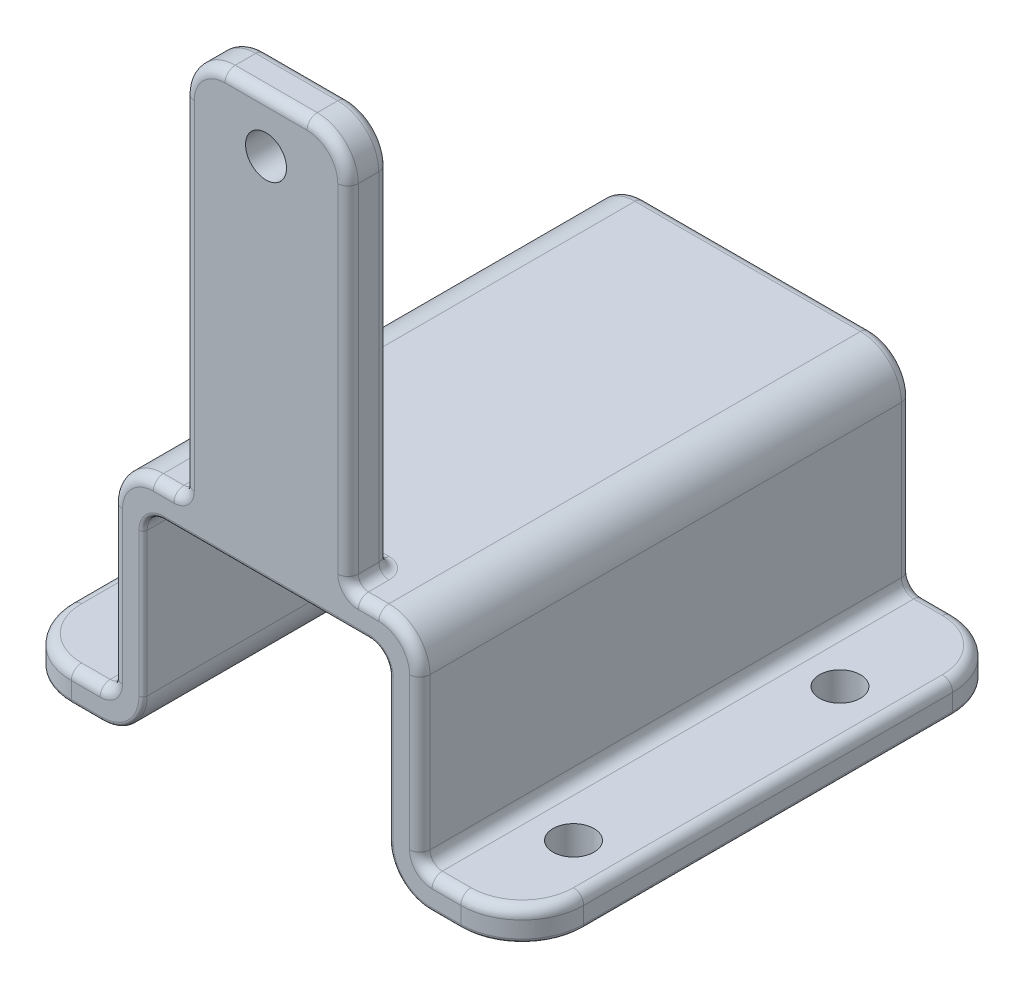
ISO-10303-21;
HEADER;
FILE_DESCRIPTION(('STEP AP214'),'2;1');
FILE_NAME('part.step','',(''),(''),'','','');
FILE_SCHEMA(('AUTOMOTIVE_DESIGN { 1 0 10303 214 1 1 1 1 }'));
ENDSEC;
DATA;
#1=APPLICATION_CONTEXT('core data for automotive mechanical design processes');
#2=APPLICATION_PROTOCOL_DEFINITION('international standard','automotive_design',2000,#1);
#3=PRODUCT_CONTEXT('',#1,'mechanical');
#4=PRODUCT('Part','Part','',(#3));
#5=PRODUCT_RELATED_PRODUCT_CATEGORY('part','',(#4));
#6=PRODUCT_DEFINITION_FORMATION('','',#4);
#7=PRODUCT_DEFINITION_CONTEXT('part definition',#1,'design');
#8=PRODUCT_DEFINITION('design','',#6,#7);
#9=PRODUCT_DEFINITION_SHAPE('','',#8);
#10=(LENGTH_UNIT() NAMED_UNIT(*) SI_UNIT(.MILLI.,.METRE.));
#11=(NAMED_UNIT(*) PLANE_ANGLE_UNIT() SI_UNIT($,.RADIAN.));
#12=(NAMED_UNIT(*) SI_UNIT($,.STERADIAN.) SOLID_ANGLE_UNIT());
#13=UNCERTAINTY_MEASURE_WITH_UNIT(LENGTH_MEASURE(1.E-05),#10,'distance_accuracy_value','');
#14=(GEOMETRIC_REPRESENTATION_CONTEXT(3) GLOBAL_UNCERTAINTY_ASSIGNED_CONTEXT((#13)) GLOBAL_UNIT_ASSIGNED_CONTEXT((#10,
#11,#12)) REPRESENTATION_CONTEXT('',''));
#15=CARTESIAN_POINT('',(0.,0.,0.));
#16=DIRECTION('',(0.,0.,1.));
#17=DIRECTION('',(1.,0.,0.));
#18=AXIS2_PLACEMENT_3D('',#15,#16,#17);
#19=CARTESIAN_POINT('',(7.5,11.5,24.));
#20=DIRECTION('',(0.,-1.,0.));
#21=DIRECTION('',(0.,0.,-1.));
#22=AXIS2_PLACEMENT_3D('',#19,#20,#21);
#23=PLANE('',#22);
#24=DIRECTION('',(0.,0.,-1.));
#25=VECTOR('',#24,1.);
#26=CARTESIAN_POINT('',(5.5,11.5,24.));
#27=LINE('',#26,#25);
#28=CARTESIAN_POINT('',(5.5,11.5,23.5));
#29=VERTEX_POINT('',#28);
#30=CARTESIAN_POINT('',(5.5,11.5,0.5));
#31=VERTEX_POINT('',#30);
#32=EDGE_CURVE('E1038',#29,#31,#27,.T.);
#33=ORIENTED_EDGE('',*,*,#32,.T.);
#34=DIRECTION('',(-1.,0.,0.));
#35=VECTOR('',#34,1.);
#36=CARTESIAN_POINT('',(-5.5,11.5,0.5));
#37=LINE('',#36,#35);
#38=CARTESIAN_POINT('',(-5.5,11.5,0.5));
#39=VERTEX_POINT('',#38);
#40=EDGE_CURVE('E571',#31,#39,#37,.T.);
#41=ORIENTED_EDGE('',*,*,#40,.T.);
#42=DIRECTION('',(0.,0.,-1.));
#43=VECTOR('',#42,1.);
#44=CARTESIAN_POINT('',(-5.5,11.5,24.));
#45=LINE('',#44,#43);
#46=CARTESIAN_POINT('',(-5.5,11.5,23.5));
#47=VERTEX_POINT('',#46);
#48=EDGE_CURVE('E1041',#39,#47,#45,.F.);
#49=ORIENTED_EDGE('',*,*,#48,.T.);
#50=DIRECTION('',(-1.,0.,0.));
#51=VECTOR('',#50,1.);
#52=CARTESIAN_POINT('',(7.5,11.5,23.5));
#53=LINE('',#52,#51);
#54=CARTESIAN_POINT('',(-4.49999999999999,11.5,23.5));
#55=VERTEX_POINT('',#54);
#56=EDGE_CURVE('E568',#47,#55,#53,.F.);
#57=ORIENTED_EDGE('',*,*,#56,.T.);
#58=DIRECTION('',(0.,0.,1.));
#59=VECTOR('',#58,1.);
#60=CARTESIAN_POINT('',(-4.49999999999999,11.5,22.));
#61=LINE('',#60,#59);
#62=CARTESIAN_POINT('',(-4.49999999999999,11.5,22.5));
#63=VERTEX_POINT('',#62);
#64=EDGE_CURVE('E564',#55,#63,#61,.F.);
#65=ORIENTED_EDGE('',*,*,#64,.T.);
#66=CARTESIAN_POINT('',(-3.49999999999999,11.5,22.5));
#67=DIRECTION('',(0.,-1.,0.));
#68=DIRECTION('',(0.,0.,-1.));
#69=AXIS2_PLACEMENT_3D('',#66,#67,#68);
#70=CIRCLE('',#69,1.);
#71=CARTESIAN_POINT('',(-3.49999999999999,11.5,21.5));
#72=VERTEX_POINT('',#71);
#73=EDGE_CURVE('E561',#72,#63,#70,.F.);
#74=ORIENTED_EDGE('',*,*,#73,.F.);
#75=DIRECTION('',(-1.,0.,0.));
#76=VECTOR('',#75,1.);
#77=CARTESIAN_POINT('',(4.00000000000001,11.5,21.5));
#78=LINE('',#77,#76);
#79=CARTESIAN_POINT('',(3.50000000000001,11.5,21.5));
#80=VERTEX_POINT('',#79);
#81=EDGE_CURVE('E557',#72,#80,#78,.F.);
#82=ORIENTED_EDGE('',*,*,#81,.T.);
#83=CARTESIAN_POINT('',(3.50000000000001,11.5,22.5));
#84=DIRECTION('',(0.,-1.,0.));
#85=DIRECTION('',(0.,0.,-1.));
#86=AXIS2_PLACEMENT_3D('',#83,#84,#85);
#87=CIRCLE('',#86,1.);
#88=CARTESIAN_POINT('',(4.50000000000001,11.5,22.5));
#89=VERTEX_POINT('',#88);
#90=EDGE_CURVE('E554',#89,#80,#87,.F.);
#91=ORIENTED_EDGE('',*,*,#90,.F.);
#92=DIRECTION('',(0.,0.,-1.));
#93=VECTOR('',#92,1.);
#94=CARTESIAN_POINT('',(4.50000000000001,11.5,24.));
#95=LINE('',#94,#93);
#96=CARTESIAN_POINT('',(4.50000000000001,11.5,23.5));
#97=VERTEX_POINT('',#96);
#98=EDGE_CURVE('E559',#89,#97,#95,.F.);
#99=ORIENTED_EDGE('',*,*,#98,.T.);
#100=DIRECTION('',(-1.,0.,0.));
#101=VECTOR('',#100,1.);
#102=CARTESIAN_POINT('',(7.5,11.5,23.5));
#103=LINE('',#102,#101);
#104=EDGE_CURVE('E566',#97,#29,#103,.F.);
#105=ORIENTED_EDGE('',*,*,#104,.T.);
#106=EDGE_LOOP('',(#33,#41,#49,#57,#65,#74,#82,#91,#99,#105));
#107=FACE_BOUND('',#106,.T.);
#108=ADVANCED_FACE('F38',(#107),#23,.F.);
#109=CARTESIAN_POINT('',(-7.5,1.5,24.));
#110=DIRECTION('',(1.,0.,0.));
#111=DIRECTION('',(0.,0.,-1.));
#112=AXIS2_PLACEMENT_3D('',#109,#110,#111);
#113=PLANE('',#112);
#114=DIRECTION('',(0.,0.,-1.));
#115=VECTOR('',#114,1.);
#116=CARTESIAN_POINT('',(-7.5,2.1,24.));
#117=LINE('',#116,#115);
#118=CARTESIAN_POINT('',(-7.5,2.1,0.5));
#119=VERTEX_POINT('',#118);
#120=CARTESIAN_POINT('',(-7.5,2.1,23.5));
#121=VERTEX_POINT('',#120);
#122=EDGE_CURVE('E484',#119,#121,#117,.F.);
#123=ORIENTED_EDGE('',*,*,#122,.T.);
#124=DIRECTION('',(0.,-1.,0.));
#125=VECTOR('',#124,1.);
#126=CARTESIAN_POINT('',(-7.5,1.5,23.5));
#127=LINE('',#126,#125);
#128=CARTESIAN_POINT('',(-7.5,9.5,23.5));
#129=VERTEX_POINT('',#128);
#130=EDGE_CURVE('E579',#121,#129,#127,.F.);
#131=ORIENTED_EDGE('',*,*,#130,.T.);
#132=DIRECTION('',(0.,0.,-1.));
#133=VECTOR('',#132,1.);
#134=CARTESIAN_POINT('',(-7.5,9.5,24.));
#135=LINE('',#134,#133);
#136=CARTESIAN_POINT('',(-7.5,9.5,0.5));
#137=VERTEX_POINT('',#136);
#138=EDGE_CURVE('E1035',#129,#137,#135,.T.);
#139=ORIENTED_EDGE('',*,*,#138,.T.);
#140=DIRECTION('',(0.,-1.,0.));
#141=VECTOR('',#140,1.);
#142=CARTESIAN_POINT('',(-7.5,2.1,0.5));
#143=LINE('',#142,#141);
#144=EDGE_CURVE('E577',#137,#119,#143,.T.);
#145=ORIENTED_EDGE('',*,*,#144,.T.);
#146=EDGE_LOOP('',(#123,#131,#139,#145));
#147=FACE_BOUND('',#146,.T.);
#148=ADVANCED_FACE('F1096',(#147),#113,.F.);
#149=CARTESIAN_POINT('',(-12.5,1.5,24.));
#150=DIRECTION('',(0.,-1.,0.));
#151=DIRECTION('',(0.,0.,-1.));
#152=AXIS2_PLACEMENT_3D('',#149,#150,#151);
#153=PLANE('',#152);
#154=CARTESIAN_POINT('',(-10.,1.5,19.));
#155=DIRECTION('',(0.,1.,0.));
#156=DIRECTION('',(0.,0.,-1.));
#157=AXIS2_PLACEMENT_3D('',#154,#155,#156);
#158=CIRCLE('',#157,1.);
#159=CARTESIAN_POINT('',(-10.,1.5,18.));
#160=VERTEX_POINT('',#159);
#161=EDGE_CURVE('E1012',#160,#160,#158,.T.);
#162=ORIENTED_EDGE('',*,*,#161,.F.);
#163=EDGE_LOOP('',(#162));
#164=FACE_BOUND('',#163,.T.);
#165=CARTESIAN_POINT('',(-10.,1.5,6.));
#166=DIRECTION('',(0.,1.,0.));
#167=DIRECTION('',(0.,0.,-1.));
#168=AXIS2_PLACEMENT_3D('',#165,#166,#167);
#169=CIRCLE('',#168,1.);
#170=CARTESIAN_POINT('',(-10.,1.5,5.));
#171=VERTEX_POINT('',#170);
#172=EDGE_CURVE('E995',#171,#171,#169,.T.);
#173=ORIENTED_EDGE('',*,*,#172,.F.);
#174=EDGE_LOOP('',(#173));
#175=FACE_BOUND('',#174,.T.);
#176=DIRECTION('',(0.,0.,-1.));
#177=VECTOR('',#176,1.);
#178=CARTESIAN_POINT('',(-8.1,1.5,0.));
#179=LINE('',#178,#177);
#180=CARTESIAN_POINT('',(-8.1,1.5,23.5));
#181=VERTEX_POINT('',#180);
#182=CARTESIAN_POINT('',(-8.1,1.5,0.5));
#183=VERTEX_POINT('',#182);
#184=EDGE_CURVE('E986',#181,#183,#179,.T.);
#185=ORIENTED_EDGE('',*,*,#184,.T.);
#186=DIRECTION('',(-1.,0.,0.));
#187=VECTOR('',#186,1.);
#188=CARTESIAN_POINT('',(-9.5,1.5,0.5));
#189=LINE('',#188,#187);
#190=CARTESIAN_POINT('',(-9.5,1.5,0.499999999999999));
#191=VERTEX_POINT('',#190);
#192=EDGE_CURVE('E593',#183,#191,#189,.T.);
#193=ORIENTED_EDGE('',*,*,#192,.T.);
#194=CARTESIAN_POINT('',(-9.5,1.5,3.));
#195=DIRECTION('',(0.,-1.,0.));
#196=DIRECTION('',(0.,0.,-1.));
#197=AXIS2_PLACEMENT_3D('',#194,#195,#196);
#198=CIRCLE('',#197,2.5);
#199=CARTESIAN_POINT('',(-12.,1.5,3.));
#200=VERTEX_POINT('',#199);
#201=EDGE_CURVE('E591',#191,#200,#198,.F.);
#202=ORIENTED_EDGE('',*,*,#201,.T.);
#203=DIRECTION('',(0.,0.,-1.));
#204=VECTOR('',#203,1.);
#205=CARTESIAN_POINT('',(-12.,1.5,24.));
#206=LINE('',#205,#204);
#207=CARTESIAN_POINT('',(-12.,1.5,21.));
#208=VERTEX_POINT('',#207);
#209=EDGE_CURVE('E589',#200,#208,#206,.F.);
#210=ORIENTED_EDGE('',*,*,#209,.T.);
#211=CARTESIAN_POINT('',(-9.5,1.5,21.));
#212=DIRECTION('',(0.,-1.,0.));
#213=DIRECTION('',(0.,0.,-1.));
#214=AXIS2_PLACEMENT_3D('',#211,#212,#213);
#215=CIRCLE('',#214,2.5);
#216=CARTESIAN_POINT('',(-9.5,1.5,23.5));
#217=VERTEX_POINT('',#216);
#218=EDGE_CURVE('E587',#208,#217,#215,.F.);
#219=ORIENTED_EDGE('',*,*,#218,.T.);
#220=DIRECTION('',(-1.,0.,0.));
#221=VECTOR('',#220,1.);
#222=CARTESIAN_POINT('',(-12.5,1.5,23.5));
#223=LINE('',#222,#221);
#224=EDGE_CURVE('E585',#217,#181,#223,.F.);
#225=ORIENTED_EDGE('',*,*,#224,.T.);
#226=EDGE_LOOP('',(#185,#193,#202,#210,#219,#225));
#227=FACE_BOUND('',#226,.T.);
#228=ADVANCED_FACE('F1110',(#164,#175,#227),#153,.F.);
#229=CARTESIAN_POINT('',(-12.5,1.5,24.));
#230=DIRECTION('',(1.,0.,0.));
#231=DIRECTION('',(0.,0.,-1.));
#232=AXIS2_PLACEMENT_3D('',#229,#230,#231);
#233=PLANE('',#232);
#234=DIRECTION('',(0.,-1.,0.));
#235=VECTOR('',#234,1.);
#236=CARTESIAN_POINT('',(-12.5,0.,3.));
#237=LINE('',#236,#235);
#238=CARTESIAN_POINT('',(-12.5,1.,3.));
#239=VERTEX_POINT('',#238);
#240=CARTESIAN_POINT('',(-12.5,0.2,3.));
#241=VERTEX_POINT('',#240);
#242=EDGE_CURVE('E960',#239,#241,#237,.T.);
#243=ORIENTED_EDGE('',*,*,#242,.T.);
#244=DIRECTION('',(0.,0.,-1.));
#245=VECTOR('',#244,1.);
#246=CARTESIAN_POINT('',(-12.5,0.2,24.));
#247=LINE('',#246,#245);
#248=CARTESIAN_POINT('',(-12.5,0.2,21.));
#249=VERTEX_POINT('',#248);
#250=EDGE_CURVE('E11',#241,#249,#247,.F.);
#251=ORIENTED_EDGE('',*,*,#250,.T.);
#252=DIRECTION('',(0.,-1.,0.));
#253=VECTOR('',#252,1.);
#254=CARTESIAN_POINT('',(-12.5,1.5,21.));
#255=LINE('',#254,#253);
#256=CARTESIAN_POINT('',(-12.5,1.,21.));
#257=VERTEX_POINT('',#256);
#258=EDGE_CURVE('E957',#249,#257,#255,.F.);
#259=ORIENTED_EDGE('',*,*,#258,.T.);
#260=DIRECTION('',(0.,0.,-1.));
#261=VECTOR('',#260,1.);
#262=CARTESIAN_POINT('',(-12.5,1.,24.));
#263=LINE('',#262,#261);
#264=EDGE_CURVE('E598',#257,#239,#263,.T.);
#265=ORIENTED_EDGE('',*,*,#264,.T.);
#266=EDGE_LOOP('',(#243,#251,#259,#265));
#267=FACE_BOUND('',#266,.T.);
#268=ADVANCED_FACE('F1053',(#267),#233,.F.);
#269=CARTESIAN_POINT('',(-12.5,0.,24.));
#270=DIRECTION('',(0.,1.,0.));
#271=DIRECTION('',(0.,0.,1.));
#272=AXIS2_PLACEMENT_3D('',#269,#270,#271);
#273=PLANE('',#272);
#274=DIRECTION('',(0.,0.,-1.));
#275=VECTOR('',#274,1.);
#276=CARTESIAN_POINT('',(-8.,0.,24.));
#277=LINE('',#276,#275);
#278=CARTESIAN_POINT('',(-8.,0.,0.199999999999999));
#279=VERTEX_POINT('',#278);
#280=CARTESIAN_POINT('',(-8.,0.,23.8));
#281=VERTEX_POINT('',#280);
#282=EDGE_CURVE('E1032',#279,#281,#277,.F.);
#283=ORIENTED_EDGE('',*,*,#282,.T.);
#284=DIRECTION('',(1.,0.,0.));
#285=VECTOR('',#284,1.);
#286=CARTESIAN_POINT('',(-12.5,0.,23.8));
#287=LINE('',#286,#285);
#288=CARTESIAN_POINT('',(-9.5,0.,23.8));
#289=VERTEX_POINT('',#288);
#290=EDGE_CURVE('E784',#281,#289,#287,.F.);
#291=ORIENTED_EDGE('',*,*,#290,.T.);
#292=CARTESIAN_POINT('',(-9.5,0.,21.));
#293=DIRECTION('',(0.,1.,0.));
#294=DIRECTION('',(0.,0.,1.));
#295=AXIS2_PLACEMENT_3D('',#292,#293,#294);
#296=CIRCLE('',#295,2.8);
#297=CARTESIAN_POINT('',(-12.3,0.,21.));
#298=VERTEX_POINT('',#297);
#299=EDGE_CURVE('E781',#289,#298,#296,.F.);
#300=ORIENTED_EDGE('',*,*,#299,.T.);
#301=DIRECTION('',(0.,0.,-1.));
#302=VECTOR('',#301,1.);
#303=CARTESIAN_POINT('',(-12.3,0.,24.));
#304=LINE('',#303,#302);
#305=CARTESIAN_POINT('',(-12.3,0.,3.));
#306=VERTEX_POINT('',#305);
#307=EDGE_CURVE('E650',#298,#306,#304,.T.);
#308=ORIENTED_EDGE('',*,*,#307,.T.);
#309=CARTESIAN_POINT('',(-9.5,0.,3.));
#310=DIRECTION('',(0.,1.,0.));
#311=DIRECTION('',(0.,0.,1.));
#312=AXIS2_PLACEMENT_3D('',#309,#310,#311);
#313=CIRCLE('',#312,2.8);
#314=CARTESIAN_POINT('',(-9.5,0.,0.199999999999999));
#315=VERTEX_POINT('',#314);
#316=EDGE_CURVE('E777',#306,#315,#313,.F.);
#317=ORIENTED_EDGE('',*,*,#316,.T.);
#318=DIRECTION('',(1.,0.,0.));
#319=VECTOR('',#318,1.);
#320=CARTESIAN_POINT('',(-8.,0.,0.199999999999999));
#321=LINE('',#320,#319);
#322=EDGE_CURVE('E779',#315,#279,#321,.T.);
#323=ORIENTED_EDGE('',*,*,#322,.T.);
#324=EDGE_LOOP('',(#283,#291,#300,#308,#317,#323));
#325=FACE_BOUND('',#324,.T.);
#326=CARTESIAN_POINT('',(-10.,0.,19.));
#327=DIRECTION('',(0.,1.,0.));
#328=DIRECTION('',(0.,0.,1.));
#329=AXIS2_PLACEMENT_3D('',#326,#327,#328);
#330=CIRCLE('',#329,1.);
#331=CARTESIAN_POINT('',(-10.,0.,20.));
#332=VERTEX_POINT('',#331);
#333=EDGE_CURVE('E996',#332,#332,#330,.T.);
#334=ORIENTED_EDGE('',*,*,#333,.T.);
#335=EDGE_LOOP('',(#334));
#336=FACE_BOUND('',#335,.T.);
#337=CARTESIAN_POINT('',(-10.,0.,6.));
#338=DIRECTION('',(0.,1.,0.));
#339=DIRECTION('',(0.,0.,1.));
#340=AXIS2_PLACEMENT_3D('',#337,#338,#339);
#341=CIRCLE('',#340,1.);
#342=CARTESIAN_POINT('',(-10.,0.,7.));
#343=VERTEX_POINT('',#342);
#344=EDGE_CURVE('E991',#343,#343,#341,.T.);
#345=ORIENTED_EDGE('',*,*,#344,.T.);
#346=EDGE_LOOP('',(#345));
#347=FACE_BOUND('',#346,.T.);
#348=ADVANCED_FACE('F1136',(#325,#336,#347),#273,.F.);
#349=CARTESIAN_POINT('',(-6.,0.,24.));
#350=DIRECTION('',(-1.,0.,0.));
#351=DIRECTION('',(0.,0.,1.));
#352=AXIS2_PLACEMENT_3D('',#349,#350,#351);
#353=PLANE('',#352);
#354=DIRECTION('',(0.,0.,-1.));
#355=VECTOR('',#354,1.);
#356=CARTESIAN_POINT('',(-6.,9.,24.));
#357=LINE('',#356,#355);
#358=CARTESIAN_POINT('',(-6.,9.,0.199999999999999));
#359=VERTEX_POINT('',#358);
#360=CARTESIAN_POINT('',(-6.,9.,23.8));
#361=VERTEX_POINT('',#360);
#362=EDGE_CURVE('E974',#359,#361,#357,.F.);
#363=ORIENTED_EDGE('',*,*,#362,.T.);
#364=DIRECTION('',(0.,1.,0.));
#365=VECTOR('',#364,1.);
#366=CARTESIAN_POINT('',(-6.,0.,23.8));
#367=LINE('',#366,#365);
#368=CARTESIAN_POINT('',(-6.,2.,23.8));
#369=VERTEX_POINT('',#368);
#370=EDGE_CURVE('E813',#361,#369,#367,.F.);
#371=ORIENTED_EDGE('',*,*,#370,.T.);
#372=DIRECTION('',(0.,0.,-1.));
#373=VECTOR('',#372,1.);
#374=CARTESIAN_POINT('',(-6.,2.,24.));
#375=LINE('',#374,#373);
#376=CARTESIAN_POINT('',(-6.,2.,0.199999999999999));
#377=VERTEX_POINT('',#376);
#378=EDGE_CURVE('E1029',#369,#377,#375,.T.);
#379=ORIENTED_EDGE('',*,*,#378,.T.);
#380=DIRECTION('',(0.,1.,0.));
#381=VECTOR('',#380,1.);
#382=CARTESIAN_POINT('',(-6.,9.,0.199999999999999));
#383=LINE('',#382,#381);
#384=EDGE_CURVE('E811',#377,#359,#383,.T.);
#385=ORIENTED_EDGE('',*,*,#384,.T.);
#386=EDGE_LOOP('',(#363,#371,#379,#385));
#387=FACE_BOUND('',#386,.T.);
#388=ADVANCED_FACE('F1154',(#387),#353,.F.);
#389=CARTESIAN_POINT('',(-6.,10.,24.));
#390=DIRECTION('',(0.,1.,0.));
#391=DIRECTION('',(0.,0.,1.));
#392=AXIS2_PLACEMENT_3D('',#389,#390,#391);
#393=PLANE('',#392);
#394=DIRECTION('',(0.,0.,-1.));
#395=VECTOR('',#394,1.);
#396=CARTESIAN_POINT('',(5.,10.,24.));
#397=LINE('',#396,#395);
#398=CARTESIAN_POINT('',(5.,10.,0.199999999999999));
#399=VERTEX_POINT('',#398);
#400=CARTESIAN_POINT('',(5.,10.,23.8));
#401=VERTEX_POINT('',#400);
#402=EDGE_CURVE('E968',#399,#401,#397,.F.);
#403=ORIENTED_EDGE('',*,*,#402,.T.);
#404=DIRECTION('',(1.,0.,0.));
#405=VECTOR('',#404,1.);
#406=CARTESIAN_POINT('',(-6.,10.,23.8));
#407=LINE('',#406,#405);
#408=CARTESIAN_POINT('',(-5.,10.,23.8));
#409=VERTEX_POINT('',#408);
#410=EDGE_CURVE('E821',#401,#409,#407,.F.);
#411=ORIENTED_EDGE('',*,*,#410,.T.);
#412=DIRECTION('',(0.,0.,-1.));
#413=VECTOR('',#412,1.);
#414=CARTESIAN_POINT('',(-5.,10.,0.));
#415=LINE('',#414,#413);
#416=CARTESIAN_POINT('',(-5.,10.,0.199999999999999));
#417=VERTEX_POINT('',#416);
#418=EDGE_CURVE('E971',#409,#417,#415,.T.);
#419=ORIENTED_EDGE('',*,*,#418,.T.);
#420=DIRECTION('',(1.,0.,0.));
#421=VECTOR('',#420,1.);
#422=CARTESIAN_POINT('',(5.,10.,0.199999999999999));
#423=LINE('',#422,#421);
#424=EDGE_CURVE('E819',#417,#399,#423,.T.);
#425=ORIENTED_EDGE('',*,*,#424,.T.);
#426=EDGE_LOOP('',(#403,#411,#419,#425));
#427=FACE_BOUND('',#426,.T.);
#428=ADVANCED_FACE('F1172',(#427),#393,.F.);
#429=CARTESIAN_POINT('',(6.,0.,24.));
#430=DIRECTION('',(1.,0.,0.));
#431=DIRECTION('',(0.,0.,-1.));
#432=AXIS2_PLACEMENT_3D('',#429,#430,#431);
#433=PLANE('',#432);
#434=DIRECTION('',(0.,0.,-1.));
#435=VECTOR('',#434,1.);
#436=CARTESIAN_POINT('',(6.,2.,24.));
#437=LINE('',#436,#435);
#438=CARTESIAN_POINT('',(6.,2.,0.199999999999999));
#439=VERTEX_POINT('',#438);
#440=CARTESIAN_POINT('',(6.,2.,23.8));
#441=VERTEX_POINT('',#440);
#442=EDGE_CURVE('E1026',#439,#441,#437,.F.);
#443=ORIENTED_EDGE('',*,*,#442,.T.);
#444=DIRECTION('',(0.,-1.,0.));
#445=VECTOR('',#444,1.);
#446=CARTESIAN_POINT('',(6.,0.,23.8));
#447=LINE('',#446,#445);
#448=CARTESIAN_POINT('',(6.,9.,23.8));
#449=VERTEX_POINT('',#448);
#450=EDGE_CURVE('E829',#441,#449,#447,.F.);
#451=ORIENTED_EDGE('',*,*,#450,.T.);
#452=DIRECTION('',(0.,0.,-1.));
#453=VECTOR('',#452,1.);
#454=CARTESIAN_POINT('',(6.,9.,0.));
#455=LINE('',#454,#453);
#456=CARTESIAN_POINT('',(6.,9.,0.199999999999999));
#457=VERTEX_POINT('',#456);
#458=EDGE_CURVE('E977',#449,#457,#455,.T.);
#459=ORIENTED_EDGE('',*,*,#458,.T.);
#460=DIRECTION('',(0.,-1.,0.));
#461=VECTOR('',#460,1.);
#462=CARTESIAN_POINT('',(6.,2.,0.199999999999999));
#463=LINE('',#462,#461);
#464=EDGE_CURVE('E827',#457,#439,#463,.T.);
#465=ORIENTED_EDGE('',*,*,#464,.T.);
#466=EDGE_LOOP('',(#443,#451,#459,#465));
#467=FACE_BOUND('',#466,.T.);
#468=ADVANCED_FACE('F1190',(#467),#433,.F.);
#469=CARTESIAN_POINT('',(6.,0.,24.));
#470=DIRECTION('',(0.,1.,0.));
#471=DIRECTION('',(-1.,0.,0.));
#472=AXIS2_PLACEMENT_3D('',#469,#470,#471);
#473=PLANE('',#472);
#474=CARTESIAN_POINT('',(10.,0.,6.));
#475=DIRECTION('',(0.,1.,0.));
#476=DIRECTION('',(-1.,0.,0.));
#477=AXIS2_PLACEMENT_3D('',#474,#475,#476);
#478=CIRCLE('',#477,1.);
#479=CARTESIAN_POINT('',(9.,0.,6.));
#480=VERTEX_POINT('',#479);
#481=EDGE_CURVE('E998',#480,#480,#478,.T.);
#482=ORIENTED_EDGE('',*,*,#481,.T.);
#483=EDGE_LOOP('',(#482));
#484=FACE_BOUND('',#483,.T.);
#485=CARTESIAN_POINT('',(10.,0.,19.));
#486=DIRECTION('',(0.,1.,0.));
#487=DIRECTION('',(-1.,0.,0.));
#488=AXIS2_PLACEMENT_3D('',#485,#486,#487);
#489=CIRCLE('',#488,1.);
#490=CARTESIAN_POINT('',(9.,0.,19.));
#491=VERTEX_POINT('',#490);
#492=EDGE_CURVE('E1015',#491,#491,#489,.T.);
#493=ORIENTED_EDGE('',*,*,#492,.T.);
#494=EDGE_LOOP('',(#493));
#495=FACE_BOUND('',#494,.T.);
#496=CARTESIAN_POINT('',(9.5,0.,21.));
#497=DIRECTION('',(0.,1.,0.));
#498=DIRECTION('',(-1.,0.,0.));
#499=AXIS2_PLACEMENT_3D('',#496,#497,#498);
#500=CIRCLE('',#499,2.8);
#501=CARTESIAN_POINT('',(12.3,0.,21.));
#502=VERTEX_POINT('',#501);
#503=CARTESIAN_POINT('',(9.5,0.,23.8));
#504=VERTEX_POINT('',#503);
#505=EDGE_CURVE('E841',#502,#504,#500,.F.);
#506=ORIENTED_EDGE('',*,*,#505,.T.);
#507=DIRECTION('',(1.,0.,0.));
#508=VECTOR('',#507,1.);
#509=CARTESIAN_POINT('',(6.,0.,23.8));
#510=LINE('',#509,#508);
#511=CARTESIAN_POINT('',(8.,0.,23.8));
#512=VERTEX_POINT('',#511);
#513=EDGE_CURVE('E843',#504,#512,#510,.F.);
#514=ORIENTED_EDGE('',*,*,#513,.T.);
#515=DIRECTION('',(0.,0.,-1.));
#516=VECTOR('',#515,1.);
#517=CARTESIAN_POINT('',(8.,0.,24.));
#518=LINE('',#517,#516);
#519=CARTESIAN_POINT('',(8.,0.,0.199999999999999));
#520=VERTEX_POINT('',#519);
#521=EDGE_CURVE('E994',#512,#520,#518,.T.);
#522=ORIENTED_EDGE('',*,*,#521,.T.);
#523=DIRECTION('',(1.,0.,0.));
#524=VECTOR('',#523,1.);
#525=CARTESIAN_POINT('',(9.5,0.,0.199999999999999));
#526=LINE('',#525,#524);
#527=CARTESIAN_POINT('',(9.5,0.,0.199999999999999));
#528=VERTEX_POINT('',#527);
#529=EDGE_CURVE('E835',#520,#528,#526,.T.);
#530=ORIENTED_EDGE('',*,*,#529,.T.);
#531=CARTESIAN_POINT('',(9.5,0.,3.));
#532=DIRECTION('',(0.,1.,0.));
#533=DIRECTION('',(-1.,0.,0.));
#534=AXIS2_PLACEMENT_3D('',#531,#532,#533);
#535=CIRCLE('',#534,2.8);
#536=CARTESIAN_POINT('',(12.3,0.,3.));
#537=VERTEX_POINT('',#536);
#538=EDGE_CURVE('E837',#528,#537,#535,.F.);
#539=ORIENTED_EDGE('',*,*,#538,.T.);
#540=DIRECTION('',(0.,0.,-1.));
#541=VECTOR('',#540,1.);
#542=CARTESIAN_POINT('',(12.3,0.,24.));
#543=LINE('',#542,#541);
#544=EDGE_CURVE('E839',#537,#502,#543,.F.);
#545=ORIENTED_EDGE('',*,*,#544,.T.);
#546=EDGE_LOOP('',(#506,#514,#522,#530,#539,#545));
#547=FACE_BOUND('',#546,.T.);
#548=ADVANCED_FACE('F1202',(#484,#495,#547),#473,.F.);
#549=CARTESIAN_POINT('',(12.5,1.5,24.));
#550=DIRECTION('',(-1.,0.,0.));
#551=DIRECTION('',(0.,0.,1.));
#552=AXIS2_PLACEMENT_3D('',#549,#550,#551);
#553=PLANE('',#552);
#554=DIRECTION('',(0.,1.,0.));
#555=VECTOR('',#554,1.);
#556=CARTESIAN_POINT('',(12.5,1.5,21.));
#557=LINE('',#556,#555);
#558=CARTESIAN_POINT('',(12.5,1.,21.));
#559=VERTEX_POINT('',#558);
#560=CARTESIAN_POINT('',(12.5,0.2,21.));
#561=VERTEX_POINT('',#560);
#562=EDGE_CURVE('E965',#559,#561,#557,.F.);
#563=ORIENTED_EDGE('',*,*,#562,.T.);
#564=DIRECTION('',(0.,0.,-1.));
#565=VECTOR('',#564,1.);
#566=CARTESIAN_POINT('',(12.5,0.2,24.));
#567=LINE('',#566,#565);
#568=CARTESIAN_POINT('',(12.5,0.2,3.));
#569=VERTEX_POINT('',#568);
#570=EDGE_CURVE('E847',#561,#569,#567,.T.);
#571=ORIENTED_EDGE('',*,*,#570,.T.);
#572=DIRECTION('',(0.,1.,0.));
#573=VECTOR('',#572,1.);
#574=CARTESIAN_POINT('',(12.5,1.5,3.));
#575=LINE('',#574,#573);
#576=CARTESIAN_POINT('',(12.5,1.,3.));
#577=VERTEX_POINT('',#576);
#578=EDGE_CURVE('E953',#569,#577,#575,.T.);
#579=ORIENTED_EDGE('',*,*,#578,.T.);
#580=DIRECTION('',(0.,0.,-1.));
#581=VECTOR('',#580,1.);
#582=CARTESIAN_POINT('',(12.5,1.,24.));
#583=LINE('',#582,#581);
#584=EDGE_CURVE('E646',#577,#559,#583,.F.);
#585=ORIENTED_EDGE('',*,*,#584,.T.);
#586=EDGE_LOOP('',(#563,#571,#579,#585));
#587=FACE_BOUND('',#586,.T.);
#588=ADVANCED_FACE('F1698',(#587),#553,.F.);
#589=CARTESIAN_POINT('',(7.5,1.5,24.));
#590=DIRECTION('',(0.,-1.,0.));
#591=DIRECTION('',(0.,0.,-1.));
#592=AXIS2_PLACEMENT_3D('',#589,#590,#591);
#593=PLANE('',#592);
#594=CARTESIAN_POINT('',(10.,1.5,6.));
#595=DIRECTION('',(0.,1.,0.));
#596=DIRECTION('',(0.,0.,1.));
#597=AXIS2_PLACEMENT_3D('',#594,#595,#596);
#598=CIRCLE('',#597,1.);
#599=CARTESIAN_POINT('',(10.,1.5,7.));
#600=VERTEX_POINT('',#599);
#601=EDGE_CURVE('E1005',#600,#600,#598,.T.);
#602=ORIENTED_EDGE('',*,*,#601,.F.);
#603=EDGE_LOOP('',(#602));
#604=FACE_BOUND('',#603,.T.);
#605=CARTESIAN_POINT('',(10.,1.5,19.));
#606=DIRECTION('',(0.,1.,0.));
#607=DIRECTION('',(0.,0.,1.));
#608=AXIS2_PLACEMENT_3D('',#605,#606,#607);
#609=CIRCLE('',#608,1.);
#610=CARTESIAN_POINT('',(10.,1.5,20.));
#611=VERTEX_POINT('',#610);
#612=EDGE_CURVE('E1001',#611,#611,#609,.T.);
#613=ORIENTED_EDGE('',*,*,#612,.F.);
#614=EDGE_LOOP('',(#613));
#615=FACE_BOUND('',#614,.T.);
#616=CARTESIAN_POINT('',(9.5,1.5,3.));
#617=DIRECTION('',(0.,-1.,0.));
#618=DIRECTION('',(0.,0.,-1.));
#619=AXIS2_PLACEMENT_3D('',#616,#617,#618);
#620=CIRCLE('',#619,2.5);
#621=CARTESIAN_POINT('',(12.,1.5,3.));
#622=VERTEX_POINT('',#621);
#623=CARTESIAN_POINT('',(9.5,1.5,0.499999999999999));
#624=VERTEX_POINT('',#623);
#625=EDGE_CURVE('E639',#622,#624,#620,.F.);
#626=ORIENTED_EDGE('',*,*,#625,.T.);
#627=DIRECTION('',(-1.,0.,0.));
#628=VECTOR('',#627,1.);
#629=CARTESIAN_POINT('',(8.1,1.5,0.5));
#630=LINE('',#629,#628);
#631=CARTESIAN_POINT('',(8.1,1.5,0.5));
#632=VERTEX_POINT('',#631);
#633=EDGE_CURVE('E641',#624,#632,#630,.T.);
#634=ORIENTED_EDGE('',*,*,#633,.T.);
#635=DIRECTION('',(0.,0.,-1.));
#636=VECTOR('',#635,1.);
#637=CARTESIAN_POINT('',(8.1,1.5,24.));
#638=LINE('',#637,#636);
#639=CARTESIAN_POINT('',(8.1,1.5,23.5));
#640=VERTEX_POINT('',#639);
#641=EDGE_CURVE('E983',#632,#640,#638,.F.);
#642=ORIENTED_EDGE('',*,*,#641,.T.);
#643=DIRECTION('',(-1.,0.,0.));
#644=VECTOR('',#643,1.);
#645=CARTESIAN_POINT('',(7.5,1.5,23.5));
#646=LINE('',#645,#644);
#647=CARTESIAN_POINT('',(9.5,1.5,23.5));
#648=VERTEX_POINT('',#647);
#649=EDGE_CURVE('E633',#640,#648,#646,.F.);
#650=ORIENTED_EDGE('',*,*,#649,.T.);
#651=CARTESIAN_POINT('',(9.5,1.5,21.));
#652=DIRECTION('',(0.,-1.,0.));
#653=DIRECTION('',(0.,0.,-1.));
#654=AXIS2_PLACEMENT_3D('',#651,#652,#653);
#655=CIRCLE('',#654,2.5);
#656=CARTESIAN_POINT('',(12.,1.5,21.));
#657=VERTEX_POINT('',#656);
#658=EDGE_CURVE('E635',#648,#657,#655,.F.);
#659=ORIENTED_EDGE('',*,*,#658,.T.);
#660=DIRECTION('',(0.,0.,-1.));
#661=VECTOR('',#660,1.);
#662=CARTESIAN_POINT('',(12.,1.5,24.));
#663=LINE('',#662,#661);
#664=EDGE_CURVE('E637',#657,#622,#663,.T.);
#665=ORIENTED_EDGE('',*,*,#664,.T.);
#666=EDGE_LOOP('',(#626,#634,#642,#650,#659,#665));
#667=FACE_BOUND('',#666,.T.);
#668=ADVANCED_FACE('F1703',(#604,#615,#667),#593,.F.);
#669=CARTESIAN_POINT('',(7.5,11.5,24.));
#670=DIRECTION('',(-1.,0.,0.));
#671=DIRECTION('',(0.,-1.,0.));
#672=AXIS2_PLACEMENT_3D('',#669,#670,#671);
#673=PLANE('',#672);
#674=DIRECTION('',(0.,0.,-1.));
#675=VECTOR('',#674,1.);
#676=CARTESIAN_POINT('',(7.5,2.1,0.));
#677=LINE('',#676,#675);
#678=CARTESIAN_POINT('',(7.5,2.1,23.5));
#679=VERTEX_POINT('',#678);
#680=CARTESIAN_POINT('',(7.5,2.1,0.5));
#681=VERTEX_POINT('',#680);
#682=EDGE_CURVE('E980',#679,#681,#677,.T.);
#683=ORIENTED_EDGE('',*,*,#682,.T.);
#684=DIRECTION('',(0.,1.,0.));
#685=VECTOR('',#684,1.);
#686=CARTESIAN_POINT('',(7.5,9.5,0.5));
#687=LINE('',#686,#685);
#688=CARTESIAN_POINT('',(7.5,9.5,0.5));
#689=VERTEX_POINT('',#688);
#690=EDGE_CURVE('E627',#681,#689,#687,.T.);
#691=ORIENTED_EDGE('',*,*,#690,.T.);
#692=DIRECTION('',(0.,0.,-1.));
#693=VECTOR('',#692,1.);
#694=CARTESIAN_POINT('',(7.5,9.5,24.));
#695=LINE('',#694,#693);
#696=CARTESIAN_POINT('',(7.5,9.5,23.5));
#697=VERTEX_POINT('',#696);
#698=EDGE_CURVE('E1044',#689,#697,#695,.F.);
#699=ORIENTED_EDGE('',*,*,#698,.T.);
#700=DIRECTION('',(0.,1.,0.));
#701=VECTOR('',#700,1.);
#702=CARTESIAN_POINT('',(7.5,11.5,23.5));
#703=LINE('',#702,#701);
#704=EDGE_CURVE('E625',#697,#679,#703,.F.);
#705=ORIENTED_EDGE('',*,*,#704,.T.);
#706=EDGE_LOOP('',(#683,#691,#699,#705));
#707=FACE_BOUND('',#706,.T.);
#708=ADVANCED_FACE('F1689',(#707),#673,.F.);
#709=CARTESIAN_POINT('',(0.,0.,24.));
#710=DIRECTION('',(0.,0.,-1.));
#711=DIRECTION('',(-1.,0.,0.));
#712=AXIS2_PLACEMENT_3D('',#709,#710,#711);
#713=PLANE('',#712);
#714=CARTESIAN_POINT('',(0.,27.9,24.));
#715=DIRECTION('',(0.,0.,1.));
#716=DIRECTION('',(1.,0.,0.));
#717=AXIS2_PLACEMENT_3D('',#714,#715,#716);
#718=CIRCLE('',#717,1.);
#719=CARTESIAN_POINT('',(1.,27.9,24.));
#720=VERTEX_POINT('',#719);
#721=EDGE_CURVE('E775',#720,#720,#718,.T.);
#722=ORIENTED_EDGE('',*,*,#721,.F.);
#723=EDGE_LOOP('',(#722));
#724=FACE_BOUND('',#723,.T.);
#725=DIRECTION('',(0.,-1.,0.));
#726=VECTOR('',#725,1.);
#727=CARTESIAN_POINT('',(-9.5,0.,24.));
#728=LINE('',#727,#726);
#729=CARTESIAN_POINT('',(-9.5,1.,24.));
#730=VERTEX_POINT('',#729);
#731=CARTESIAN_POINT('',(-9.5,0.2,24.));
#732=VERTEX_POINT('',#731);
#733=EDGE_CURVE('E1049',#730,#732,#728,.T.);
#734=ORIENTED_EDGE('',*,*,#733,.T.);
#735=DIRECTION('',(1.,0.,0.));
#736=VECTOR('',#735,1.);
#737=CARTESIAN_POINT('',(0.,0.2,24.));
#738=LINE('',#737,#736);
#739=CARTESIAN_POINT('',(-8.,0.2,24.));
#740=VERTEX_POINT('',#739);
#741=EDGE_CURVE('E805',#732,#740,#738,.T.);
#742=ORIENTED_EDGE('',*,*,#741,.T.);
#743=CARTESIAN_POINT('',(-8.,2.,24.));
#744=DIRECTION('',(0.,0.,-1.));
#745=DIRECTION('',(-1.,0.,0.));
#746=AXIS2_PLACEMENT_3D('',#743,#744,#745);
#747=CIRCLE('',#746,1.8);
#748=CARTESIAN_POINT('',(-6.2,2.,24.));
#749=VERTEX_POINT('',#748);
#750=EDGE_CURVE('E803',#740,#749,#747,.F.);
#751=ORIENTED_EDGE('',*,*,#750,.T.);
#752=DIRECTION('',(0.,1.,0.));
#753=VECTOR('',#752,1.);
#754=CARTESIAN_POINT('',(-6.2,0.,24.));
#755=LINE('',#754,#753);
#756=CARTESIAN_POINT('',(-6.2,9.,24.));
#757=VERTEX_POINT('',#756);
#758=EDGE_CURVE('E801',#749,#757,#755,.T.);
#759=ORIENTED_EDGE('',*,*,#758,.T.);
#760=CARTESIAN_POINT('',(-5.,9.,24.));
#761=DIRECTION('',(0.,0.,-1.));
#762=DIRECTION('',(-1.,0.,0.));
#763=AXIS2_PLACEMENT_3D('',#760,#761,#762);
#764=CIRCLE('',#763,1.2);
#765=CARTESIAN_POINT('',(-5.,10.2,24.));
#766=VERTEX_POINT('',#765);
#767=EDGE_CURVE('E799',#757,#766,#764,.T.);
#768=ORIENTED_EDGE('',*,*,#767,.T.);
#769=DIRECTION('',(1.,0.,0.));
#770=VECTOR('',#769,1.);
#771=CARTESIAN_POINT('',(0.,10.2,24.));
#772=LINE('',#771,#770);
#773=CARTESIAN_POINT('',(5.,10.2,24.));
#774=VERTEX_POINT('',#773);
#775=EDGE_CURVE('E797',#766,#774,#772,.T.);
#776=ORIENTED_EDGE('',*,*,#775,.T.);
#777=CARTESIAN_POINT('',(5.,9.,24.));
#778=DIRECTION('',(0.,0.,-1.));
#779=DIRECTION('',(-1.,0.,0.));
#780=AXIS2_PLACEMENT_3D('',#777,#778,#779);
#781=CIRCLE('',#780,1.2);
#782=CARTESIAN_POINT('',(6.2,9.,24.));
#783=VERTEX_POINT('',#782);
#784=EDGE_CURVE('E795',#774,#783,#781,.T.);
#785=ORIENTED_EDGE('',*,*,#784,.T.);
#786=DIRECTION('',(0.,-1.,0.));
#787=VECTOR('',#786,1.);
#788=CARTESIAN_POINT('',(6.2,0.,24.));
#789=LINE('',#788,#787);
#790=CARTESIAN_POINT('',(6.2,2.,24.));
#791=VERTEX_POINT('',#790);
#792=EDGE_CURVE('E793',#783,#791,#789,.T.);
#793=ORIENTED_EDGE('',*,*,#792,.T.);
#794=CARTESIAN_POINT('',(8.,2.,24.));
#795=DIRECTION('',(0.,0.,-1.));
#796=DIRECTION('',(-1.,0.,0.));
#797=AXIS2_PLACEMENT_3D('',#794,#795,#796);
#798=CIRCLE('',#797,1.8);
#799=CARTESIAN_POINT('',(8.,0.200000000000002,24.));
#800=VERTEX_POINT('',#799);
#801=EDGE_CURVE('E791',#791,#800,#798,.F.);
#802=ORIENTED_EDGE('',*,*,#801,.T.);
#803=DIRECTION('',(1.,0.,0.));
#804=VECTOR('',#803,1.);
#805=CARTESIAN_POINT('',(0.,0.200000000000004,24.));
#806=LINE('',#805,#804);
#807=CARTESIAN_POINT('',(9.5,0.200000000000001,24.));
#808=VERTEX_POINT('',#807);
#809=EDGE_CURVE('E789',#800,#808,#806,.T.);
#810=ORIENTED_EDGE('',*,*,#809,.T.);
#811=DIRECTION('',(0.,1.,0.));
#812=VECTOR('',#811,1.);
#813=CARTESIAN_POINT('',(9.5,0.,24.));
#814=LINE('',#813,#812);
#815=CARTESIAN_POINT('',(9.5,1.,24.));
#816=VERTEX_POINT('',#815);
#817=EDGE_CURVE('E1047',#808,#816,#814,.T.);
#818=ORIENTED_EDGE('',*,*,#817,.T.);
#819=DIRECTION('',(-1.,0.,0.));
#820=VECTOR('',#819,1.);
#821=CARTESIAN_POINT('',(0.,1.,24.));
#822=LINE('',#821,#820);
#823=CARTESIAN_POINT('',(8.1,1.,24.));
#824=VERTEX_POINT('',#823);
#825=EDGE_CURVE('E501',#816,#824,#822,.T.);
#826=ORIENTED_EDGE('',*,*,#825,.T.);
#827=CARTESIAN_POINT('',(8.1,2.1,24.));
#828=DIRECTION('',(0.,0.,-1.));
#829=DIRECTION('',(-1.,0.,0.));
#830=AXIS2_PLACEMENT_3D('',#827,#828,#829);
#831=CIRCLE('',#830,1.1);
#832=CARTESIAN_POINT('',(7.,2.1,24.));
#833=VERTEX_POINT('',#832);
#834=EDGE_CURVE('E499',#824,#833,#831,.T.);
#835=ORIENTED_EDGE('',*,*,#834,.T.);
#836=DIRECTION('',(0.,1.,0.));
#837=VECTOR('',#836,1.);
#838=CARTESIAN_POINT('',(7.,0.,24.));
#839=LINE('',#838,#837);
#840=CARTESIAN_POINT('',(7.,9.5,24.));
#841=VERTEX_POINT('',#840);
#842=EDGE_CURVE('E497',#833,#841,#839,.T.);
#843=ORIENTED_EDGE('',*,*,#842,.T.);
#844=CARTESIAN_POINT('',(5.5,9.5,24.));
#845=DIRECTION('',(0.,0.,-1.));
#846=DIRECTION('',(-1.,0.,0.));
#847=AXIS2_PLACEMENT_3D('',#844,#845,#846);
#848=CIRCLE('',#847,1.5);
#849=CARTESIAN_POINT('',(5.5,11.,24.));
#850=VERTEX_POINT('',#849);
#851=EDGE_CURVE('E495',#841,#850,#848,.F.);
#852=ORIENTED_EDGE('',*,*,#851,.T.);
#853=DIRECTION('',(-1.,0.,0.));
#854=VECTOR('',#853,1.);
#855=CARTESIAN_POINT('',(0.,11.,24.));
#856=LINE('',#855,#854);
#857=CARTESIAN_POINT('',(4.50000000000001,11.,24.));
#858=VERTEX_POINT('',#857);
#859=EDGE_CURVE('E493',#850,#858,#856,.T.);
#860=ORIENTED_EDGE('',*,*,#859,.T.);
#861=CARTESIAN_POINT('',(4.50000000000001,12.,24.));
#862=DIRECTION('',(0.,0.,-1.));
#863=DIRECTION('',(-1.,0.,0.));
#864=AXIS2_PLACEMENT_3D('',#861,#862,#863);
#865=CIRCLE('',#864,1.);
#866=CARTESIAN_POINT('',(3.50000000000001,12.,24.));
#867=VERTEX_POINT('',#866);
#868=EDGE_CURVE('E475',#867,#858,#865,.F.);
#869=ORIENTED_EDGE('',*,*,#868,.F.);
#870=DIRECTION('',(0.,-1.,0.));
#871=VECTOR('',#870,1.);
#872=CARTESIAN_POINT('',(3.50000000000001,0.,24.));
#873=LINE('',#872,#871);
#874=CARTESIAN_POINT('',(3.50000000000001,28.5,24.));
#875=VERTEX_POINT('',#874);
#876=EDGE_CURVE('E503',#867,#875,#873,.F.);
#877=ORIENTED_EDGE('',*,*,#876,.T.);
#878=CARTESIAN_POINT('',(2.00000000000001,28.5,24.));
#879=DIRECTION('',(0.,0.,-1.));
#880=DIRECTION('',(-1.,0.,0.));
#881=AXIS2_PLACEMENT_3D('',#878,#879,#880);
#882=CIRCLE('',#881,1.5);
#883=CARTESIAN_POINT('',(2.00000000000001,30.,24.));
#884=VERTEX_POINT('',#883);
#885=EDGE_CURVE('E505',#875,#884,#882,.F.);
#886=ORIENTED_EDGE('',*,*,#885,.T.);
#887=DIRECTION('',(1.,0.,0.));
#888=VECTOR('',#887,1.);
#889=CARTESIAN_POINT('',(0.,30.,24.));
#890=LINE('',#889,#888);
#891=CARTESIAN_POINT('',(-1.99999999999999,30.,24.));
#892=VERTEX_POINT('',#891);
#893=EDGE_CURVE('E449',#884,#892,#890,.F.);
#894=ORIENTED_EDGE('',*,*,#893,.T.);
#895=CARTESIAN_POINT('',(-1.99999999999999,28.5,24.));
#896=DIRECTION('',(0.,0.,-1.));
#897=DIRECTION('',(-1.,0.,0.));
#898=AXIS2_PLACEMENT_3D('',#895,#896,#897);
#899=CIRCLE('',#898,1.5);
#900=CARTESIAN_POINT('',(-3.49999999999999,28.5,24.));
#901=VERTEX_POINT('',#900);
#902=EDGE_CURVE('E508',#892,#901,#899,.F.);
#903=ORIENTED_EDGE('',*,*,#902,.T.);
#904=DIRECTION('',(0.,-1.,0.));
#905=VECTOR('',#904,1.);
#906=CARTESIAN_POINT('',(-3.49999999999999,0.,24.));
#907=LINE('',#906,#905);
#908=CARTESIAN_POINT('',(-3.49999999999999,12.,24.));
#909=VERTEX_POINT('',#908);
#910=EDGE_CURVE('E510',#901,#909,#907,.T.);
#911=ORIENTED_EDGE('',*,*,#910,.T.);
#912=CARTESIAN_POINT('',(-4.49999999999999,12.,24.));
#913=DIRECTION('',(0.,0.,-1.));
#914=DIRECTION('',(-1.,0.,0.));
#915=AXIS2_PLACEMENT_3D('',#912,#913,#914);
#916=CIRCLE('',#915,1.);
#917=CARTESIAN_POINT('',(-4.49999999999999,11.,24.));
#918=VERTEX_POINT('',#917);
#919=EDGE_CURVE('E512',#918,#909,#916,.F.);
#920=ORIENTED_EDGE('',*,*,#919,.F.);
#921=DIRECTION('',(-1.,0.,0.));
#922=VECTOR('',#921,1.);
#923=CARTESIAN_POINT('',(0.,11.,24.));
#924=LINE('',#923,#922);
#925=CARTESIAN_POINT('',(-5.5,11.,24.));
#926=VERTEX_POINT('',#925);
#927=EDGE_CURVE('E515',#918,#926,#924,.T.);
#928=ORIENTED_EDGE('',*,*,#927,.T.);
#929=CARTESIAN_POINT('',(-5.5,9.5,24.));
#930=DIRECTION('',(0.,0.,-1.));
#931=DIRECTION('',(-1.,0.,0.));
#932=AXIS2_PLACEMENT_3D('',#929,#930,#931);
#933=CIRCLE('',#932,1.5);
#934=CARTESIAN_POINT('',(-7.,9.5,24.));
#935=VERTEX_POINT('',#934);
#936=EDGE_CURVE('E517',#926,#935,#933,.F.);
#937=ORIENTED_EDGE('',*,*,#936,.T.);
#938=DIRECTION('',(0.,-1.,0.));
#939=VECTOR('',#938,1.);
#940=CARTESIAN_POINT('',(-7.,0.,24.));
#941=LINE('',#940,#939);
#942=CARTESIAN_POINT('',(-7.,2.1,24.));
#943=VERTEX_POINT('',#942);
#944=EDGE_CURVE('E519',#935,#943,#941,.T.);
#945=ORIENTED_EDGE('',*,*,#944,.T.);
#946=CARTESIAN_POINT('',(-8.1,2.1,24.));
#947=DIRECTION('',(0.,0.,-1.));
#948=DIRECTION('',(-1.,0.,0.));
#949=AXIS2_PLACEMENT_3D('',#946,#947,#948);
#950=CIRCLE('',#949,1.1);
#951=CARTESIAN_POINT('',(-8.1,1.,24.));
#952=VERTEX_POINT('',#951);
#953=EDGE_CURVE('E521',#943,#952,#950,.T.);
#954=ORIENTED_EDGE('',*,*,#953,.T.);
#955=DIRECTION('',(-1.,0.,0.));
#956=VECTOR('',#955,1.);
#957=CARTESIAN_POINT('',(0.,1.,24.));
#958=LINE('',#957,#956);
#959=EDGE_CURVE('E523',#952,#730,#958,.T.);
#960=ORIENTED_EDGE('',*,*,#959,.T.);
#961=EDGE_LOOP('',(#734,#742,#751,#759,#768,#776,#785,#793,#802,#810,#818,#826,#835,#843,#852,
#860,#869,#877,#886,#894,#903,#911,#920,#928,#937,#945,#954,#960));
#962=FACE_BOUND('',#961,.T.);
#963=ADVANCED_FACE('F1076',(#724,#962),#713,.F.);
#964=CARTESIAN_POINT('',(0.,0.,0.));
#965=DIRECTION('',(0.,0.,-1.));
#966=DIRECTION('',(-1.,0.,0.));
#967=AXIS2_PLACEMENT_3D('',#964,#965,#966);
#968=PLANE('',#967);
#969=DIRECTION('',(0.,1.,0.));
#970=VECTOR('',#969,1.);
#971=CARTESIAN_POINT('',(9.5,0.,0.));
#972=LINE('',#971,#970);
#973=CARTESIAN_POINT('',(9.5,1.,0.));
#974=VERTEX_POINT('',#973);
#975=CARTESIAN_POINT('',(9.5,0.200000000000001,0.));
#976=VERTEX_POINT('',#975);
#977=EDGE_CURVE('E951',#974,#976,#972,.F.);
#978=ORIENTED_EDGE('',*,*,#977,.T.);
#979=DIRECTION('',(1.,0.,0.));
#980=VECTOR('',#979,1.);
#981=CARTESIAN_POINT('',(8.,0.200000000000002,0.));
#982=LINE('',#981,#980);
#983=CARTESIAN_POINT('',(8.,0.200000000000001,0.));
#984=VERTEX_POINT('',#983);
#985=EDGE_CURVE('E62',#976,#984,#982,.F.);
#986=ORIENTED_EDGE('',*,*,#985,.T.);
#987=CARTESIAN_POINT('',(8.,2.,0.));
#988=DIRECTION('',(0.,0.,-1.));
#989=DIRECTION('',(-1.,0.,0.));
#990=AXIS2_PLACEMENT_3D('',#987,#988,#989);
#991=CIRCLE('',#990,1.8);
#992=CARTESIAN_POINT('',(6.2,2.,0.));
#993=VERTEX_POINT('',#992);
#994=EDGE_CURVE('E865',#984,#993,#991,.T.);
#995=ORIENTED_EDGE('',*,*,#994,.T.);
#996=DIRECTION('',(0.,-1.,0.));
#997=VECTOR('',#996,1.);
#998=CARTESIAN_POINT('',(6.2,9.,0.));
#999=LINE('',#998,#997);
#1000=CARTESIAN_POINT('',(6.2,9.,0.));
#1001=VERTEX_POINT('',#1000);
#1002=EDGE_CURVE('E863',#993,#1001,#999,.F.);
#1003=ORIENTED_EDGE('',*,*,#1002,.T.);
#1004=CARTESIAN_POINT('',(5.,9.,0.));
#1005=DIRECTION('',(0.,0.,-1.));
#1006=DIRECTION('',(-1.,0.,0.));
#1007=AXIS2_PLACEMENT_3D('',#1004,#1005,#1006);
#1008=CIRCLE('',#1007,1.2);
#1009=CARTESIAN_POINT('',(5.,10.2,0.));
#1010=VERTEX_POINT('',#1009);
#1011=EDGE_CURVE('E861',#1001,#1010,#1008,.F.);
#1012=ORIENTED_EDGE('',*,*,#1011,.T.);
#1013=DIRECTION('',(1.,0.,0.));
#1014=VECTOR('',#1013,1.);
#1015=CARTESIAN_POINT('',(-5.,10.2,0.));
#1016=LINE('',#1015,#1014);
#1017=CARTESIAN_POINT('',(-5.,10.2,0.));
#1018=VERTEX_POINT('',#1017);
#1019=EDGE_CURVE('E859',#1010,#1018,#1016,.F.);
#1020=ORIENTED_EDGE('',*,*,#1019,.T.);
#1021=CARTESIAN_POINT('',(-5.,9.,0.));
#1022=DIRECTION('',(0.,0.,-1.));
#1023=DIRECTION('',(-1.,0.,0.));
#1024=AXIS2_PLACEMENT_3D('',#1021,#1022,#1023);
#1025=CIRCLE('',#1024,1.2);
#1026=CARTESIAN_POINT('',(-6.2,9.,0.));
#1027=VERTEX_POINT('',#1026);
#1028=EDGE_CURVE('E857',#1018,#1027,#1025,.F.);
#1029=ORIENTED_EDGE('',*,*,#1028,.T.);
#1030=DIRECTION('',(0.,1.,0.));
#1031=VECTOR('',#1030,1.);
#1032=CARTESIAN_POINT('',(-6.2,2.,0.));
#1033=LINE('',#1032,#1031);
#1034=CARTESIAN_POINT('',(-6.2,2.,0.));
#1035=VERTEX_POINT('',#1034);
#1036=EDGE_CURVE('E855',#1027,#1035,#1033,.F.);
#1037=ORIENTED_EDGE('',*,*,#1036,.T.);
#1038=CARTESIAN_POINT('',(-8.,2.,0.));
#1039=DIRECTION('',(0.,0.,-1.));
#1040=DIRECTION('',(-1.,0.,0.));
#1041=AXIS2_PLACEMENT_3D('',#1038,#1039,#1040);
#1042=CIRCLE('',#1041,1.8);
#1043=CARTESIAN_POINT('',(-8.,0.2,0.));
#1044=VERTEX_POINT('',#1043);
#1045=EDGE_CURVE('E853',#1035,#1044,#1042,.T.);
#1046=ORIENTED_EDGE('',*,*,#1045,.T.);
#1047=DIRECTION('',(1.,0.,0.));
#1048=VECTOR('',#1047,1.);
#1049=CARTESIAN_POINT('',(-9.5,0.2,0.));
#1050=LINE('',#1049,#1048);
#1051=CARTESIAN_POINT('',(-9.5,0.2,0.));
#1052=VERTEX_POINT('',#1051);
#1053=EDGE_CURVE('E851',#1044,#1052,#1050,.F.);
#1054=ORIENTED_EDGE('',*,*,#1053,.T.);
#1055=DIRECTION('',(0.,-1.,0.));
#1056=VECTOR('',#1055,1.);
#1057=CARTESIAN_POINT('',(-9.5,1.5,0.));
#1058=LINE('',#1057,#1056);
#1059=CARTESIAN_POINT('',(-9.5,1.,0.));
#1060=VERTEX_POINT('',#1059);
#1061=EDGE_CURVE('E956',#1052,#1060,#1058,.F.);
#1062=ORIENTED_EDGE('',*,*,#1061,.T.);
#1063=DIRECTION('',(-1.,0.,0.));
#1064=VECTOR('',#1063,1.);
#1065=CARTESIAN_POINT('',(-8.1,1.,0.));
#1066=LINE('',#1065,#1064);
#1067=CARTESIAN_POINT('',(-8.1,1.,0.));
#1068=VERTEX_POINT('',#1067);
#1069=EDGE_CURVE('E619',#1060,#1068,#1066,.F.);
#1070=ORIENTED_EDGE('',*,*,#1069,.T.);
#1071=CARTESIAN_POINT('',(-8.1,2.1,0.));
#1072=DIRECTION('',(0.,0.,-1.));
#1073=DIRECTION('',(-1.,0.,0.));
#1074=AXIS2_PLACEMENT_3D('',#1071,#1072,#1073);
#1075=CIRCLE('',#1074,1.1);
#1076=CARTESIAN_POINT('',(-7.,2.1,0.));
#1077=VERTEX_POINT('',#1076);
#1078=EDGE_CURVE('E617',#1068,#1077,#1075,.F.);
#1079=ORIENTED_EDGE('',*,*,#1078,.T.);
#1080=DIRECTION('',(0.,-1.,0.));
#1081=VECTOR('',#1080,1.);
#1082=CARTESIAN_POINT('',(-7.,9.5,0.));
#1083=LINE('',#1082,#1081);
#1084=CARTESIAN_POINT('',(-7.,9.5,0.));
#1085=VERTEX_POINT('',#1084);
#1086=EDGE_CURVE('E615',#1077,#1085,#1083,.F.);
#1087=ORIENTED_EDGE('',*,*,#1086,.T.);
#1088=CARTESIAN_POINT('',(-5.5,9.5,0.));
#1089=DIRECTION('',(0.,0.,-1.));
#1090=DIRECTION('',(-1.,0.,0.));
#1091=AXIS2_PLACEMENT_3D('',#1088,#1089,#1090);
#1092=CIRCLE('',#1091,1.5);
#1093=CARTESIAN_POINT('',(-5.5,11.,0.));
#1094=VERTEX_POINT('',#1093);
#1095=EDGE_CURVE('E613',#1085,#1094,#1092,.T.);
#1096=ORIENTED_EDGE('',*,*,#1095,.T.);
#1097=DIRECTION('',(-1.,0.,0.));
#1098=VECTOR('',#1097,1.);
#1099=CARTESIAN_POINT('',(5.5,11.,0.));
#1100=LINE('',#1099,#1098);
#1101=CARTESIAN_POINT('',(5.5,11.,0.));
#1102=VERTEX_POINT('',#1101);
#1103=EDGE_CURVE('E611',#1094,#1102,#1100,.F.);
#1104=ORIENTED_EDGE('',*,*,#1103,.T.);
#1105=CARTESIAN_POINT('',(5.5,9.5,0.));
#1106=DIRECTION('',(0.,0.,-1.));
#1107=DIRECTION('',(-1.,0.,0.));
#1108=AXIS2_PLACEMENT_3D('',#1105,#1106,#1107);
#1109=CIRCLE('',#1108,1.5);
#1110=CARTESIAN_POINT('',(7.,9.5,0.));
#1111=VERTEX_POINT('',#1110);
#1112=EDGE_CURVE('E609',#1102,#1111,#1109,.T.);
#1113=ORIENTED_EDGE('',*,*,#1112,.T.);
#1114=DIRECTION('',(0.,1.,0.));
#1115=VECTOR('',#1114,1.);
#1116=CARTESIAN_POINT('',(7.,2.1,0.));
#1117=LINE('',#1116,#1115);
#1118=CARTESIAN_POINT('',(7.,2.1,0.));
#1119=VERTEX_POINT('',#1118);
#1120=EDGE_CURVE('E607',#1111,#1119,#1117,.F.);
#1121=ORIENTED_EDGE('',*,*,#1120,.T.);
#1122=CARTESIAN_POINT('',(8.1,2.1,0.));
#1123=DIRECTION('',(0.,0.,-1.));
#1124=DIRECTION('',(-1.,0.,0.));
#1125=AXIS2_PLACEMENT_3D('',#1122,#1123,#1124);
#1126=CIRCLE('',#1125,1.1);
#1127=CARTESIAN_POINT('',(8.1,1.,0.));
#1128=VERTEX_POINT('',#1127);
#1129=EDGE_CURVE('E605',#1119,#1128,#1126,.F.);
#1130=ORIENTED_EDGE('',*,*,#1129,.T.);
#1131=DIRECTION('',(-1.,0.,0.));
#1132=VECTOR('',#1131,1.);
#1133=CARTESIAN_POINT('',(9.5,1.,0.));
#1134=LINE('',#1133,#1132);
#1135=EDGE_CURVE('E603',#1128,#974,#1134,.F.);
#1136=ORIENTED_EDGE('',*,*,#1135,.T.);
#1137=EDGE_LOOP('',(#978,#986,#995,#1003,#1012,#1020,#1029,#1037,#1046,#1054,#1062,#1070,#1079,
#1087,#1096,#1104,#1113,#1121,#1130,#1136));
#1138=FACE_BOUND('',#1137,.T.);
#1139=ADVANCED_FACE('F954',(#1138),#968,.T.);
#1140=CARTESIAN_POINT('',(8.,2.,24.));
#1141=DIRECTION('',(0.,0.,-1.));
#1142=DIRECTION('',(-1.,0.,0.));
#1143=AXIS2_PLACEMENT_3D('',#1140,#1141,#1142);
#1144=CYLINDRICAL_SURFACE('',#1143,2.);
#1145=ORIENTED_EDGE('',*,*,#521,.F.);
#1146=CARTESIAN_POINT('',(8.,2.,23.8));
#1147=DIRECTION('',(0.,0.,-1.));
#1148=DIRECTION('',(-1.,0.,0.));
#1149=AXIS2_PLACEMENT_3D('',#1146,#1147,#1148);
#1150=CIRCLE('',#1149,2.);
#1151=EDGE_CURVE('E833',#512,#441,#1150,.T.);
#1152=ORIENTED_EDGE('',*,*,#1151,.T.);
#1153=ORIENTED_EDGE('',*,*,#442,.F.);
#1154=CARTESIAN_POINT('',(8.,2.,0.199999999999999));
#1155=DIRECTION('',(0.,0.,-1.));
#1156=DIRECTION('',(-1.,0.,0.));
#1157=AXIS2_PLACEMENT_3D('',#1154,#1155,#1156);
#1158=CIRCLE('',#1157,2.);
#1159=EDGE_CURVE('E831',#439,#520,#1158,.F.);
#1160=ORIENTED_EDGE('',*,*,#1159,.T.);
#1161=EDGE_LOOP('',(#1145,#1152,#1153,#1160));
#1162=FACE_BOUND('',#1161,.T.);
#1163=ADVANCED_FACE('F1195',(#1162),#1144,.T.);
#1164=CARTESIAN_POINT('',(-8.,2.,24.));
#1165=DIRECTION('',(0.,0.,-1.));
#1166=DIRECTION('',(-1.,0.,0.));
#1167=AXIS2_PLACEMENT_3D('',#1164,#1165,#1166);
#1168=CYLINDRICAL_SURFACE('',#1167,2.);
#1169=ORIENTED_EDGE('',*,*,#378,.F.);
#1170=CARTESIAN_POINT('',(-8.,2.,23.8));
#1171=DIRECTION('',(0.,0.,-1.));
#1172=DIRECTION('',(-1.,0.,0.));
#1173=AXIS2_PLACEMENT_3D('',#1170,#1171,#1172);
#1174=CIRCLE('',#1173,2.);
#1175=EDGE_CURVE('E809',#369,#281,#1174,.T.);
#1176=ORIENTED_EDGE('',*,*,#1175,.T.);
#1177=ORIENTED_EDGE('',*,*,#282,.F.);
#1178=CARTESIAN_POINT('',(-8.,2.,0.199999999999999));
#1179=DIRECTION('',(0.,0.,-1.));
#1180=DIRECTION('',(-1.,0.,0.));
#1181=AXIS2_PLACEMENT_3D('',#1178,#1179,#1180);
#1182=CIRCLE('',#1181,2.);
#1183=EDGE_CURVE('E807',#279,#377,#1182,.F.);
#1184=ORIENTED_EDGE('',*,*,#1183,.T.);
#1185=EDGE_LOOP('',(#1169,#1176,#1177,#1184));
#1186=FACE_BOUND('',#1185,.T.);
#1187=ADVANCED_FACE('F1142',(#1186),#1168,.T.);
#1188=CARTESIAN_POINT('',(-5.5,9.5,24.));
#1189=DIRECTION('',(0.,0.,-1.));
#1190=DIRECTION('',(-1.,0.,0.));
#1191=AXIS2_PLACEMENT_3D('',#1188,#1189,#1190);
#1192=CYLINDRICAL_SURFACE('',#1191,2.);
#1193=ORIENTED_EDGE('',*,*,#138,.F.);
#1194=CARTESIAN_POINT('',(-5.5,9.5,23.5));
#1195=DIRECTION('',(0.,0.,-1.));
#1196=DIRECTION('',(-1.,0.,0.));
#1197=AXIS2_PLACEMENT_3D('',#1194,#1195,#1196);
#1198=CIRCLE('',#1197,2.);
#1199=EDGE_CURVE('E575',#129,#47,#1198,.T.);
#1200=ORIENTED_EDGE('',*,*,#1199,.T.);
#1201=ORIENTED_EDGE('',*,*,#48,.F.);
#1202=CARTESIAN_POINT('',(-5.5,9.5,0.5));
#1203=DIRECTION('',(0.,0.,-1.));
#1204=DIRECTION('',(-1.,0.,0.));
#1205=AXIS2_PLACEMENT_3D('',#1202,#1203,#1204);
#1206=CIRCLE('',#1205,2.);
#1207=EDGE_CURVE('E573',#39,#137,#1206,.F.);
#1208=ORIENTED_EDGE('',*,*,#1207,.T.);
#1209=EDGE_LOOP('',(#1193,#1200,#1201,#1208));
#1210=FACE_BOUND('',#1209,.T.);
#1211=ADVANCED_FACE('F1258',(#1210),#1192,.T.);
#1212=CARTESIAN_POINT('',(5.5,9.5,24.));
#1213=DIRECTION('',(0.,0.,-1.));
#1214=DIRECTION('',(-1.,0.,0.));
#1215=AXIS2_PLACEMENT_3D('',#1212,#1213,#1214);
#1216=CYLINDRICAL_SURFACE('',#1215,2.);
#1217=ORIENTED_EDGE('',*,*,#698,.F.);
#1218=CARTESIAN_POINT('',(5.5,9.5,0.5));
#1219=DIRECTION('',(0.,0.,-1.));
#1220=DIRECTION('',(-1.,0.,0.));
#1221=AXIS2_PLACEMENT_3D('',#1218,#1219,#1220);
#1222=CIRCLE('',#1221,2.);
#1223=EDGE_CURVE('E623',#689,#31,#1222,.F.);
#1224=ORIENTED_EDGE('',*,*,#1223,.T.);
#1225=ORIENTED_EDGE('',*,*,#32,.F.);
#1226=CARTESIAN_POINT('',(5.5,9.5,23.5));
#1227=DIRECTION('',(0.,0.,-1.));
#1228=DIRECTION('',(-1.,0.,0.));
#1229=AXIS2_PLACEMENT_3D('',#1226,#1227,#1228);
#1230=CIRCLE('',#1229,2.);
#1231=EDGE_CURVE('E621',#29,#697,#1230,.T.);
#1232=ORIENTED_EDGE('',*,*,#1231,.T.);
#1233=EDGE_LOOP('',(#1217,#1224,#1225,#1232));
#1234=FACE_BOUND('',#1233,.T.);
#1235=ADVANCED_FACE('F1261',(#1234),#1216,.T.);
#1236=CARTESIAN_POINT('',(-9.5,0.,21.));
#1237=DIRECTION('',(0.,-1.,0.));
#1238=DIRECTION('',(0.,0.,-1.));
#1239=AXIS2_PLACEMENT_3D('',#1236,#1237,#1238);
#1240=CYLINDRICAL_SURFACE('',#1239,3.);
#1241=ORIENTED_EDGE('',*,*,#258,.F.);
#1242=CARTESIAN_POINT('',(-9.5,0.2,21.));
#1243=DIRECTION('',(0.,1.,0.));
#1244=DIRECTION('',(0.,0.,1.));
#1245=AXIS2_PLACEMENT_3D('',#1242,#1243,#1244);
#1246=CIRCLE('',#1245,3.);
#1247=EDGE_CURVE('E786',#249,#732,#1246,.T.);
#1248=ORIENTED_EDGE('',*,*,#1247,.T.);
#1249=ORIENTED_EDGE('',*,*,#733,.F.);
#1250=CARTESIAN_POINT('',(-9.5,1.,21.));
#1251=DIRECTION('',(0.,-1.,0.));
#1252=DIRECTION('',(0.,0.,-1.));
#1253=AXIS2_PLACEMENT_3D('',#1250,#1251,#1252);
#1254=CIRCLE('',#1253,3.);
#1255=EDGE_CURVE('E595',#730,#257,#1254,.T.);
#1256=ORIENTED_EDGE('',*,*,#1255,.T.);
#1257=EDGE_LOOP('',(#1241,#1248,#1249,#1256));
#1258=FACE_BOUND('',#1257,.T.);
#1259=ADVANCED_FACE('F1073',(#1258),#1240,.T.);
#1260=CARTESIAN_POINT('',(-9.5,1.5,3.));
#1261=DIRECTION('',(0.,1.,0.));
#1262=DIRECTION('',(0.,0.,1.));
#1263=AXIS2_PLACEMENT_3D('',#1260,#1261,#1262);
#1264=CYLINDRICAL_SURFACE('',#1263,3.);
#1265=ORIENTED_EDGE('',*,*,#1061,.F.);
#1266=CARTESIAN_POINT('',(-9.5,0.2,3.));
#1267=DIRECTION('',(0.,1.,0.));
#1268=DIRECTION('',(0.,0.,1.));
#1269=AXIS2_PLACEMENT_3D('',#1266,#1267,#1268);
#1270=CIRCLE('',#1269,3.);
#1271=EDGE_CURVE('E47',#1052,#241,#1270,.T.);
#1272=ORIENTED_EDGE('',*,*,#1271,.T.);
#1273=ORIENTED_EDGE('',*,*,#242,.F.);
#1274=CARTESIAN_POINT('',(-9.5,1.,3.));
#1275=DIRECTION('',(0.,-1.,0.));
#1276=DIRECTION('',(0.,0.,-1.));
#1277=AXIS2_PLACEMENT_3D('',#1274,#1275,#1276);
#1278=CIRCLE('',#1277,3.);
#1279=EDGE_CURVE('E600',#239,#1060,#1278,.T.);
#1280=ORIENTED_EDGE('',*,*,#1279,.T.);
#1281=EDGE_LOOP('',(#1265,#1272,#1273,#1280));
#1282=FACE_BOUND('',#1281,.T.);
#1283=ADVANCED_FACE('F1124',(#1282),#1264,.T.);
#1284=CARTESIAN_POINT('',(9.5,0.,21.));
#1285=DIRECTION('',(0.,1.,0.));
#1286=DIRECTION('',(0.,0.,1.));
#1287=AXIS2_PLACEMENT_3D('',#1284,#1285,#1286);
#1288=CYLINDRICAL_SURFACE('',#1287,3.);
#1289=ORIENTED_EDGE('',*,*,#817,.F.);
#1290=CARTESIAN_POINT('',(9.5,0.200000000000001,21.));
#1291=DIRECTION('',(0.,1.,0.));
#1292=DIRECTION('',(-1.,0.,0.));
#1293=AXIS2_PLACEMENT_3D('',#1290,#1291,#1292);
#1294=CIRCLE('',#1293,3.);
#1295=EDGE_CURVE('E845',#808,#561,#1294,.T.);
#1296=ORIENTED_EDGE('',*,*,#1295,.T.);
#1297=ORIENTED_EDGE('',*,*,#562,.F.);
#1298=CARTESIAN_POINT('',(9.5,1.,21.));
#1299=DIRECTION('',(0.,-1.,0.));
#1300=DIRECTION('',(0.,0.,-1.));
#1301=AXIS2_PLACEMENT_3D('',#1298,#1299,#1300);
#1302=CIRCLE('',#1301,3.);
#1303=EDGE_CURVE('E648',#559,#816,#1302,.T.);
#1304=ORIENTED_EDGE('',*,*,#1303,.T.);
#1305=EDGE_LOOP('',(#1289,#1296,#1297,#1304));
#1306=FACE_BOUND('',#1305,.T.);
#1307=ADVANCED_FACE('F1270',(#1306),#1288,.T.);
#1308=CARTESIAN_POINT('',(9.5,1.5,3.));
#1309=DIRECTION('',(0.,-1.,0.));
#1310=DIRECTION('',(0.,0.,-1.));
#1311=AXIS2_PLACEMENT_3D('',#1308,#1309,#1310);
#1312=CYLINDRICAL_SURFACE('',#1311,3.);
#1313=ORIENTED_EDGE('',*,*,#578,.F.);
#1314=CARTESIAN_POINT('',(9.5,0.200000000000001,3.));
#1315=DIRECTION('',(0.,1.,0.));
#1316=DIRECTION('',(-1.,0.,0.));
#1317=AXIS2_PLACEMENT_3D('',#1314,#1315,#1316);
#1318=CIRCLE('',#1317,3.);
#1319=EDGE_CURVE('E849',#569,#976,#1318,.T.);
#1320=ORIENTED_EDGE('',*,*,#1319,.T.);
#1321=ORIENTED_EDGE('',*,*,#977,.F.);
#1322=CARTESIAN_POINT('',(9.5,1.,3.));
#1323=DIRECTION('',(0.,-1.,0.));
#1324=DIRECTION('',(0.,0.,-1.));
#1325=AXIS2_PLACEMENT_3D('',#1322,#1323,#1324);
#1326=CIRCLE('',#1325,3.);
#1327=EDGE_CURVE('E643',#974,#577,#1326,.T.);
#1328=ORIENTED_EDGE('',*,*,#1327,.T.);
#1329=EDGE_LOOP('',(#1313,#1320,#1321,#1328));
#1330=FACE_BOUND('',#1329,.T.);
#1331=ADVANCED_FACE('F950',(#1330),#1312,.T.);
#1332=CARTESIAN_POINT('',(-5.,9.,24.));
#1333=DIRECTION('',(0.,0.,1.));
#1334=DIRECTION('',(1.,0.,0.));
#1335=AXIS2_PLACEMENT_3D('',#1332,#1333,#1334);
#1336=CYLINDRICAL_SURFACE('',#1335,1.);
#1337=ORIENTED_EDGE('',*,*,#418,.F.);
#1338=CARTESIAN_POINT('',(-5.,9.,23.8));
#1339=DIRECTION('',(0.,0.,-1.));
#1340=DIRECTION('',(-1.,0.,0.));
#1341=AXIS2_PLACEMENT_3D('',#1338,#1339,#1340);
#1342=CIRCLE('',#1341,1.);
#1343=EDGE_CURVE('E817',#409,#361,#1342,.F.);
#1344=ORIENTED_EDGE('',*,*,#1343,.T.);
#1345=ORIENTED_EDGE('',*,*,#362,.F.);
#1346=CARTESIAN_POINT('',(-5.,9.,0.199999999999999));
#1347=DIRECTION('',(0.,0.,-1.));
#1348=DIRECTION('',(-1.,0.,0.));
#1349=AXIS2_PLACEMENT_3D('',#1346,#1347,#1348);
#1350=CIRCLE('',#1349,1.);
#1351=EDGE_CURVE('E815',#359,#417,#1350,.T.);
#1352=ORIENTED_EDGE('',*,*,#1351,.T.);
#1353=EDGE_LOOP('',(#1337,#1344,#1345,#1352));
#1354=FACE_BOUND('',#1353,.T.);
#1355=ADVANCED_FACE('F1159',(#1354),#1336,.F.);
#1356=CARTESIAN_POINT('',(5.,9.,24.));
#1357=DIRECTION('',(0.,0.,1.));
#1358=DIRECTION('',(1.,0.,0.));
#1359=AXIS2_PLACEMENT_3D('',#1356,#1357,#1358);
#1360=CYLINDRICAL_SURFACE('',#1359,1.);
#1361=ORIENTED_EDGE('',*,*,#458,.F.);
#1362=CARTESIAN_POINT('',(5.,9.,23.8));
#1363=DIRECTION('',(0.,0.,-1.));
#1364=DIRECTION('',(-1.,0.,0.));
#1365=AXIS2_PLACEMENT_3D('',#1362,#1363,#1364);
#1366=CIRCLE('',#1365,1.);
#1367=EDGE_CURVE('E825',#449,#401,#1366,.F.);
#1368=ORIENTED_EDGE('',*,*,#1367,.T.);
#1369=ORIENTED_EDGE('',*,*,#402,.F.);
#1370=CARTESIAN_POINT('',(5.,9.,0.199999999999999));
#1371=DIRECTION('',(0.,0.,-1.));
#1372=DIRECTION('',(-1.,0.,0.));
#1373=AXIS2_PLACEMENT_3D('',#1370,#1371,#1372);
#1374=CIRCLE('',#1373,1.);
#1375=EDGE_CURVE('E823',#399,#457,#1374,.T.);
#1376=ORIENTED_EDGE('',*,*,#1375,.T.);
#1377=EDGE_LOOP('',(#1361,#1368,#1369,#1376));
#1378=FACE_BOUND('',#1377,.T.);
#1379=ADVANCED_FACE('F1177',(#1378),#1360,.F.);
#1380=CARTESIAN_POINT('',(8.1,2.1,24.));
#1381=DIRECTION('',(0.,0.,1.));
#1382=DIRECTION('',(1.,0.,0.));
#1383=AXIS2_PLACEMENT_3D('',#1380,#1381,#1382);
#1384=CYLINDRICAL_SURFACE('',#1383,0.6);
#1385=ORIENTED_EDGE('',*,*,#641,.F.);
#1386=CARTESIAN_POINT('',(8.1,2.1,0.5));
#1387=DIRECTION('',(0.,0.,-1.));
#1388=DIRECTION('',(-1.,0.,0.));
#1389=AXIS2_PLACEMENT_3D('',#1386,#1387,#1388);
#1390=CIRCLE('',#1389,0.6);
#1391=EDGE_CURVE('E631',#632,#681,#1390,.T.);
#1392=ORIENTED_EDGE('',*,*,#1391,.T.);
#1393=ORIENTED_EDGE('',*,*,#682,.F.);
#1394=CARTESIAN_POINT('',(8.1,2.1,23.5));
#1395=DIRECTION('',(0.,0.,-1.));
#1396=DIRECTION('',(-1.,0.,0.));
#1397=AXIS2_PLACEMENT_3D('',#1394,#1395,#1396);
#1398=CIRCLE('',#1397,0.6);
#1399=EDGE_CURVE('E629',#679,#640,#1398,.F.);
#1400=ORIENTED_EDGE('',*,*,#1399,.T.);
#1401=EDGE_LOOP('',(#1385,#1392,#1393,#1400));
#1402=FACE_BOUND('',#1401,.T.);
#1403=ADVANCED_FACE('F1280',(#1402),#1384,.F.);
#1404=CARTESIAN_POINT('',(-8.1,2.1,24.));
#1405=DIRECTION('',(0.,0.,1.));
#1406=DIRECTION('',(1.,0.,0.));
#1407=AXIS2_PLACEMENT_3D('',#1404,#1405,#1406);
#1408=CYLINDRICAL_SURFACE('',#1407,0.6);
#1409=ORIENTED_EDGE('',*,*,#184,.F.);
#1410=CARTESIAN_POINT('',(-8.1,2.1,23.5));
#1411=DIRECTION('',(0.,0.,-1.));
#1412=DIRECTION('',(-1.,0.,0.));
#1413=AXIS2_PLACEMENT_3D('',#1410,#1411,#1412);
#1414=CIRCLE('',#1413,0.6);
#1415=EDGE_CURVE('E583',#181,#121,#1414,.F.);
#1416=ORIENTED_EDGE('',*,*,#1415,.T.);
#1417=ORIENTED_EDGE('',*,*,#122,.F.);
#1418=CARTESIAN_POINT('',(-8.1,2.1,0.5));
#1419=DIRECTION('',(0.,0.,-1.));
#1420=DIRECTION('',(-1.,0.,0.));
#1421=AXIS2_PLACEMENT_3D('',#1418,#1419,#1420);
#1422=CIRCLE('',#1421,0.6);
#1423=EDGE_CURVE('E581',#119,#183,#1422,.T.);
#1424=ORIENTED_EDGE('',*,*,#1423,.T.);
#1425=EDGE_LOOP('',(#1409,#1416,#1417,#1424));
#1426=FACE_BOUND('',#1425,.T.);
#1427=ADVANCED_FACE('F1093',(#1426),#1408,.F.);
#1428=CARTESIAN_POINT('',(-10.,-8.5,6.));
#1429=DIRECTION('',(0.,1.,0.));
#1430=DIRECTION('',(0.,0.,1.));
#1431=AXIS2_PLACEMENT_3D('',#1428,#1429,#1430);
#1432=CYLINDRICAL_SURFACE('',#1431,1.);
#1433=ORIENTED_EDGE('',*,*,#172,.T.);
#1434=EDGE_LOOP('',(#1433));
#1435=FACE_BOUND('',#1434,.T.);
#1436=ORIENTED_EDGE('',*,*,#344,.F.);
#1437=EDGE_LOOP('',(#1436));
#1438=FACE_BOUND('',#1437,.T.);
#1439=ADVANCED_FACE('F1286',(#1435,#1438),#1432,.F.);
#1440=CARTESIAN_POINT('',(10.,-8.5,19.));
#1441=DIRECTION('',(0.,1.,0.));
#1442=DIRECTION('',(0.,0.,1.));
#1443=AXIS2_PLACEMENT_3D('',#1440,#1441,#1442);
#1444=CYLINDRICAL_SURFACE('',#1443,1.);
#1445=ORIENTED_EDGE('',*,*,#612,.T.);
#1446=EDGE_LOOP('',(#1445));
#1447=FACE_BOUND('',#1446,.T.);
#1448=ORIENTED_EDGE('',*,*,#492,.F.);
#1449=EDGE_LOOP('',(#1448));
#1450=FACE_BOUND('',#1449,.T.);
#1451=ADVANCED_FACE('F2142',(#1447,#1450),#1444,.F.);
#1452=CARTESIAN_POINT('',(10.,-8.5,6.));
#1453=DIRECTION('',(0.,1.,0.));
#1454=DIRECTION('',(0.,0.,1.));
#1455=AXIS2_PLACEMENT_3D('',#1452,#1453,#1454);
#1456=CYLINDRICAL_SURFACE('',#1455,1.);
#1457=ORIENTED_EDGE('',*,*,#601,.T.);
#1458=EDGE_LOOP('',(#1457));
#1459=FACE_BOUND('',#1458,.T.);
#1460=ORIENTED_EDGE('',*,*,#481,.F.);
#1461=EDGE_LOOP('',(#1460));
#1462=FACE_BOUND('',#1461,.T.);
#1463=ADVANCED_FACE('F2132',(#1459,#1462),#1456,.F.);
#1464=CARTESIAN_POINT('',(-10.,-8.5,19.));
#1465=DIRECTION('',(0.,1.,0.));
#1466=DIRECTION('',(0.,0.,1.));
#1467=AXIS2_PLACEMENT_3D('',#1464,#1465,#1466);
#1468=CYLINDRICAL_SURFACE('',#1467,1.);
#1469=ORIENTED_EDGE('',*,*,#161,.T.);
#1470=EDGE_LOOP('',(#1469));
#1471=FACE_BOUND('',#1470,.T.);
#1472=ORIENTED_EDGE('',*,*,#333,.F.);
#1473=EDGE_LOOP('',(#1472));
#1474=FACE_BOUND('',#1473,.T.);
#1475=ADVANCED_FACE('F2063',(#1471,#1474),#1468,.F.);
#1476=CARTESIAN_POINT('',(-3.99999999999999,30.5,22.));
#1477=DIRECTION('',(1.,0.,0.));
#1478=DIRECTION('',(0.,0.,-1.));
#1479=AXIS2_PLACEMENT_3D('',#1476,#1477,#1478);
#1480=PLANE('',#1479);
#1481=DIRECTION('',(0.,0.,1.));
#1482=VECTOR('',#1481,1.);
#1483=CARTESIAN_POINT('',(-3.99999999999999,12.,24.));
#1484=LINE('',#1483,#1482);
#1485=CARTESIAN_POINT('',(-3.99999999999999,12.,22.5));
#1486=VERTEX_POINT('',#1485);
#1487=CARTESIAN_POINT('',(-3.99999999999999,12.,23.5));
#1488=VERTEX_POINT('',#1487);
#1489=EDGE_CURVE('E463',#1486,#1488,#1484,.T.);
#1490=ORIENTED_EDGE('',*,*,#1489,.T.);
#1491=DIRECTION('',(0.,-1.,0.));
#1492=VECTOR('',#1491,1.);
#1493=CARTESIAN_POINT('',(-3.99999999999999,30.5,23.5));
#1494=LINE('',#1493,#1492);
#1495=CARTESIAN_POINT('',(-3.99999999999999,28.5,23.5));
#1496=VERTEX_POINT('',#1495);
#1497=EDGE_CURVE('E533',#1488,#1496,#1494,.F.);
#1498=ORIENTED_EDGE('',*,*,#1497,.T.);
#1499=DIRECTION('',(0.,0.,1.));
#1500=VECTOR('',#1499,1.);
#1501=CARTESIAN_POINT('',(-3.99999999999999,28.5,22.));
#1502=LINE('',#1501,#1500);
#1503=CARTESIAN_POINT('',(-3.99999999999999,28.5,22.5));
#1504=VERTEX_POINT('',#1503);
#1505=EDGE_CURVE('E482',#1496,#1504,#1502,.F.);
#1506=ORIENTED_EDGE('',*,*,#1505,.T.);
#1507=DIRECTION('',(0.,-1.,0.));
#1508=VECTOR('',#1507,1.);
#1509=CARTESIAN_POINT('',(-3.99999999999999,30.5,22.5));
#1510=LINE('',#1509,#1508);
#1511=EDGE_CURVE('E531',#1504,#1486,#1510,.T.);
#1512=ORIENTED_EDGE('',*,*,#1511,.T.);
#1513=EDGE_LOOP('',(#1490,#1498,#1506,#1512));
#1514=FACE_BOUND('',#1513,.T.);
#1515=ADVANCED_FACE('F2054',(#1514),#1480,.F.);
#1516=CARTESIAN_POINT('',(4.00000000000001,30.5,22.));
#1517=DIRECTION('',(-1.,0.,0.));
#1518=DIRECTION('',(0.,0.,1.));
#1519=AXIS2_PLACEMENT_3D('',#1516,#1517,#1518);
#1520=PLANE('',#1519);
#1521=DIRECTION('',(0.,0.,-1.));
#1522=VECTOR('',#1521,1.);
#1523=CARTESIAN_POINT('',(4.00000000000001,28.5,22.));
#1524=LINE('',#1523,#1522);
#1525=CARTESIAN_POINT('',(4.00000000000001,28.5,22.5));
#1526=VERTEX_POINT('',#1525);
#1527=CARTESIAN_POINT('',(4.00000000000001,28.5,23.5));
#1528=VERTEX_POINT('',#1527);
#1529=EDGE_CURVE('E480',#1526,#1528,#1524,.F.);
#1530=ORIENTED_EDGE('',*,*,#1529,.T.);
#1531=DIRECTION('',(0.,-1.,0.));
#1532=VECTOR('',#1531,1.);
#1533=CARTESIAN_POINT('',(4.00000000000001,30.5,23.5));
#1534=LINE('',#1533,#1532);
#1535=CARTESIAN_POINT('',(4.00000000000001,12.,23.5));
#1536=VERTEX_POINT('',#1535);
#1537=EDGE_CURVE('E539',#1528,#1536,#1534,.T.);
#1538=ORIENTED_EDGE('',*,*,#1537,.T.);
#1539=DIRECTION('',(0.,0.,-1.));
#1540=VECTOR('',#1539,1.);
#1541=CARTESIAN_POINT('',(4.00000000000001,12.,22.));
#1542=LINE('',#1541,#1540);
#1543=CARTESIAN_POINT('',(4.00000000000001,12.,22.5));
#1544=VERTEX_POINT('',#1543);
#1545=EDGE_CURVE('E535',#1536,#1544,#1542,.T.);
#1546=ORIENTED_EDGE('',*,*,#1545,.T.);
#1547=DIRECTION('',(0.,-1.,0.));
#1548=VECTOR('',#1547,1.);
#1549=CARTESIAN_POINT('',(4.00000000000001,30.5,22.5));
#1550=LINE('',#1549,#1548);
#1551=EDGE_CURVE('E537',#1544,#1526,#1550,.F.);
#1552=ORIENTED_EDGE('',*,*,#1551,.T.);
#1553=EDGE_LOOP('',(#1530,#1538,#1546,#1552));
#1554=FACE_BOUND('',#1553,.T.);
#1555=ADVANCED_FACE('F2044',(#1554),#1520,.F.);
#1556=CARTESIAN_POINT('',(4.00000000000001,30.5,22.));
#1557=DIRECTION('',(0.,0.,1.));
#1558=DIRECTION('',(1.,0.,0.));
#1559=AXIS2_PLACEMENT_3D('',#1556,#1557,#1558);
#1560=PLANE('',#1559);
#1561=DIRECTION('',(-1.,0.,0.));
#1562=VECTOR('',#1561,1.);
#1563=CARTESIAN_POINT('',(-3.99999999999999,12.,22.));
#1564=LINE('',#1563,#1562);
#1565=CARTESIAN_POINT('',(3.50000000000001,12.,22.));
#1566=VERTEX_POINT('',#1565);
#1567=CARTESIAN_POINT('',(-3.49999999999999,12.,22.));
#1568=VERTEX_POINT('',#1567);
#1569=EDGE_CURVE('E541',#1566,#1568,#1564,.T.);
#1570=ORIENTED_EDGE('',*,*,#1569,.T.);
#1571=DIRECTION('',(0.,-1.,0.));
#1572=VECTOR('',#1571,1.);
#1573=CARTESIAN_POINT('',(-3.49999999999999,30.5,22.));
#1574=LINE('',#1573,#1572);
#1575=CARTESIAN_POINT('',(-3.49999999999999,28.5,22.));
#1576=VERTEX_POINT('',#1575);
#1577=EDGE_CURVE('E551',#1568,#1576,#1574,.F.);
#1578=ORIENTED_EDGE('',*,*,#1577,.T.);
#1579=CARTESIAN_POINT('',(-1.99999999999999,28.5,22.));
#1580=DIRECTION('',(0.,0.,1.));
#1581=DIRECTION('',(1.,0.,0.));
#1582=AXIS2_PLACEMENT_3D('',#1579,#1580,#1581);
#1583=CIRCLE('',#1582,1.5);
#1584=CARTESIAN_POINT('',(-1.99999999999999,30.,22.));
#1585=VERTEX_POINT('',#1584);
#1586=EDGE_CURVE('E549',#1576,#1585,#1583,.F.);
#1587=ORIENTED_EDGE('',*,*,#1586,.T.);
#1588=DIRECTION('',(-1.,0.,0.));
#1589=VECTOR('',#1588,1.);
#1590=CARTESIAN_POINT('',(4.00000000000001,30.,22.));
#1591=LINE('',#1590,#1589);
#1592=CARTESIAN_POINT('',(2.00000000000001,30.,22.));
#1593=VERTEX_POINT('',#1592);
#1594=EDGE_CURVE('E547',#1585,#1593,#1591,.F.);
#1595=ORIENTED_EDGE('',*,*,#1594,.T.);
#1596=CARTESIAN_POINT('',(2.00000000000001,28.5,22.));
#1597=DIRECTION('',(0.,0.,1.));
#1598=DIRECTION('',(1.,0.,0.));
#1599=AXIS2_PLACEMENT_3D('',#1596,#1597,#1598);
#1600=CIRCLE('',#1599,1.5);
#1601=CARTESIAN_POINT('',(3.50000000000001,28.5,22.));
#1602=VERTEX_POINT('',#1601);
#1603=EDGE_CURVE('E545',#1593,#1602,#1600,.F.);
#1604=ORIENTED_EDGE('',*,*,#1603,.T.);
#1605=DIRECTION('',(0.,-1.,0.));
#1606=VECTOR('',#1605,1.);
#1607=CARTESIAN_POINT('',(3.50000000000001,30.5,22.));
#1608=LINE('',#1607,#1606);
#1609=EDGE_CURVE('E543',#1602,#1566,#1608,.T.);
#1610=ORIENTED_EDGE('',*,*,#1609,.T.);
#1611=EDGE_LOOP('',(#1570,#1578,#1587,#1595,#1604,#1610));
#1612=FACE_BOUND('',#1611,.T.);
#1613=CARTESIAN_POINT('',(0.,27.9,22.));
#1614=DIRECTION('',(0.,0.,1.));
#1615=DIRECTION('',(1.,0.,0.));
#1616=AXIS2_PLACEMENT_3D('',#1613,#1614,#1615);
#1617=CIRCLE('',#1616,1.);
#1618=CARTESIAN_POINT('',(1.,27.9,22.));
#1619=VERTEX_POINT('',#1618);
#1620=EDGE_CURVE('E999',#1619,#1619,#1617,.T.);
#1621=ORIENTED_EDGE('',*,*,#1620,.T.);
#1622=EDGE_LOOP('',(#1621));
#1623=FACE_BOUND('',#1622,.T.);
#1624=ADVANCED_FACE('F2035',(#1612,#1623),#1560,.F.);
#1625=CARTESIAN_POINT('',(0.,30.5,0.));
#1626=DIRECTION('',(0.,-1.,0.));
#1627=DIRECTION('',(0.,0.,-1.));
#1628=AXIS2_PLACEMENT_3D('',#1625,#1626,#1627);
#1629=PLANE('',#1628);
#1630=DIRECTION('',(0.,0.,1.));
#1631=VECTOR('',#1630,1.);
#1632=CARTESIAN_POINT('',(-1.99999999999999,30.5,0.));
#1633=LINE('',#1632,#1631);
#1634=CARTESIAN_POINT('',(-1.99999999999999,30.5,22.5));
#1635=VERTEX_POINT('',#1634);
#1636=CARTESIAN_POINT('',(-1.99999999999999,30.5,23.5));
#1637=VERTEX_POINT('',#1636);
#1638=EDGE_CURVE('E473',#1635,#1637,#1633,.T.);
#1639=ORIENTED_EDGE('',*,*,#1638,.T.);
#1640=DIRECTION('',(1.,0.,0.));
#1641=VECTOR('',#1640,1.);
#1642=CARTESIAN_POINT('',(0.,30.5,23.5));
#1643=LINE('',#1642,#1641);
#1644=CARTESIAN_POINT('',(2.00000000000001,30.5,23.5));
#1645=VERTEX_POINT('',#1644);
#1646=EDGE_CURVE('E447',#1637,#1645,#1643,.T.);
#1647=ORIENTED_EDGE('',*,*,#1646,.T.);
#1648=DIRECTION('',(0.,0.,-1.));
#1649=VECTOR('',#1648,1.);
#1650=CARTESIAN_POINT('',(2.00000000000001,30.5,0.));
#1651=LINE('',#1650,#1649);
#1652=CARTESIAN_POINT('',(2.00000000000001,30.5,22.5));
#1653=VERTEX_POINT('',#1652);
#1654=EDGE_CURVE('E470',#1645,#1653,#1651,.T.);
#1655=ORIENTED_EDGE('',*,*,#1654,.T.);
#1656=DIRECTION('',(-1.,0.,0.));
#1657=VECTOR('',#1656,1.);
#1658=CARTESIAN_POINT('',(0.,30.5,22.5));
#1659=LINE('',#1658,#1657);
#1660=EDGE_CURVE('E476',#1653,#1635,#1659,.T.);
#1661=ORIENTED_EDGE('',*,*,#1660,.T.);
#1662=EDGE_LOOP('',(#1639,#1647,#1655,#1661));
#1663=FACE_BOUND('',#1662,.T.);
#1664=ADVANCED_FACE('F469',(#1663),#1629,.F.);
#1665=CARTESIAN_POINT('',(0.,27.9,18.));
#1666=DIRECTION('',(0.,0.,1.));
#1667=DIRECTION('',(1.,0.,0.));
#1668=AXIS2_PLACEMENT_3D('',#1665,#1666,#1667);
#1669=CYLINDRICAL_SURFACE('',#1668,1.);
#1670=ORIENTED_EDGE('',*,*,#721,.T.);
#1671=EDGE_LOOP('',(#1670));
#1672=FACE_BOUND('',#1671,.T.);
#1673=ORIENTED_EDGE('',*,*,#1620,.F.);
#1674=EDGE_LOOP('',(#1673));
#1675=FACE_BOUND('',#1674,.T.);
#1676=ADVANCED_FACE('F1290',(#1672,#1675),#1669,.F.);
#1677=CARTESIAN_POINT('',(2.00000000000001,28.5,0.));
#1678=DIRECTION('',(0.,0.,-1.));
#1679=DIRECTION('',(-1.,0.,0.));
#1680=AXIS2_PLACEMENT_3D('',#1677,#1678,#1679);
#1681=CYLINDRICAL_SURFACE('',#1680,2.);
#1682=ORIENTED_EDGE('',*,*,#1654,.F.);
#1683=CARTESIAN_POINT('',(2.00000000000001,28.5,23.5));
#1684=DIRECTION('',(0.,0.,-1.));
#1685=DIRECTION('',(-1.,0.,0.));
#1686=AXIS2_PLACEMENT_3D('',#1683,#1684,#1685);
#1687=CIRCLE('',#1686,2.);
#1688=EDGE_CURVE('E455',#1645,#1528,#1687,.T.);
#1689=ORIENTED_EDGE('',*,*,#1688,.T.);
#1690=ORIENTED_EDGE('',*,*,#1529,.F.);
#1691=CARTESIAN_POINT('',(2.00000000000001,28.5,22.5));
#1692=DIRECTION('',(0.,0.,1.));
#1693=DIRECTION('',(1.,0.,0.));
#1694=AXIS2_PLACEMENT_3D('',#1691,#1692,#1693);
#1695=CIRCLE('',#1694,2.);
#1696=EDGE_CURVE('E464',#1526,#1653,#1695,.T.);
#1697=ORIENTED_EDGE('',*,*,#1696,.T.);
#1698=EDGE_LOOP('',(#1682,#1689,#1690,#1697));
#1699=FACE_BOUND('',#1698,.T.);
#1700=ADVANCED_FACE('F478',(#1699),#1681,.T.);
#1701=CARTESIAN_POINT('',(-1.99999999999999,28.5,0.));
#1702=DIRECTION('',(0.,0.,1.));
#1703=DIRECTION('',(1.,0.,0.));
#1704=AXIS2_PLACEMENT_3D('',#1701,#1702,#1703);
#1705=CYLINDRICAL_SURFACE('',#1704,2.);
#1706=ORIENTED_EDGE('',*,*,#1505,.F.);
#1707=CARTESIAN_POINT('',(-1.99999999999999,28.5,23.5));
#1708=DIRECTION('',(0.,0.,-1.));
#1709=DIRECTION('',(-1.,0.,0.));
#1710=AXIS2_PLACEMENT_3D('',#1707,#1708,#1709);
#1711=CIRCLE('',#1710,2.);
#1712=EDGE_CURVE('E527',#1496,#1637,#1711,.T.);
#1713=ORIENTED_EDGE('',*,*,#1712,.T.);
#1714=ORIENTED_EDGE('',*,*,#1638,.F.);
#1715=CARTESIAN_POINT('',(-1.99999999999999,28.5,22.5));
#1716=DIRECTION('',(0.,0.,1.));
#1717=DIRECTION('',(1.,0.,0.));
#1718=AXIS2_PLACEMENT_3D('',#1715,#1716,#1717);
#1719=CIRCLE('',#1718,2.);
#1720=EDGE_CURVE('E525',#1635,#1504,#1719,.T.);
#1721=ORIENTED_EDGE('',*,*,#1720,.T.);
#1722=EDGE_LOOP('',(#1706,#1713,#1714,#1721));
#1723=FACE_BOUND('',#1722,.T.);
#1724=ADVANCED_FACE('F1289',(#1723),#1705,.T.);
#1725=CARTESIAN_POINT('',(7.5,11.,0.5));
#1726=DIRECTION('',(1.,0.,0.));
#1727=DIRECTION('',(0.,0.,-1.));
#1728=AXIS2_PLACEMENT_3D('',#1725,#1726,#1727);
#1729=CYLINDRICAL_SURFACE('',#1728,0.5);
#1730=CARTESIAN_POINT('',(5.5,11.,0.5));
#1731=DIRECTION('',(1.,0.,0.));
#1732=DIRECTION('',(0.,0.,-1.));
#1733=AXIS2_PLACEMENT_3D('',#1730,#1731,#1732);
#1734=CIRCLE('',#1733,0.5);
#1735=EDGE_CURVE('E769',#1102,#31,#1734,.T.);
#1736=ORIENTED_EDGE('',*,*,#1735,.F.);
#1737=ORIENTED_EDGE('',*,*,#1103,.F.);
#1738=CARTESIAN_POINT('',(-5.5,11.,0.5));
#1739=DIRECTION('',(-1.,0.,0.));
#1740=DIRECTION('',(0.,0.,1.));
#1741=AXIS2_PLACEMENT_3D('',#1738,#1739,#1740);
#1742=CIRCLE('',#1741,0.5);
#1743=EDGE_CURVE('E772',#39,#1094,#1742,.T.);
#1744=ORIENTED_EDGE('',*,*,#1743,.F.);
#1745=ORIENTED_EDGE('',*,*,#40,.F.);
#1746=EDGE_LOOP('',(#1736,#1737,#1744,#1745));
#1747=FACE_BOUND('',#1746,.T.);
#1748=ADVANCED_FACE('F1293',(#1747),#1729,.T.);
#1749=CARTESIAN_POINT('',(-5.5,9.5,0.5));
#1750=DIRECTION('',(0.,0.,-1.));
#1751=DIRECTION('',(-1.,0.,0.));
#1752=AXIS2_PLACEMENT_3D('',#1749,#1750,#1751);
#1753=TOROIDAL_SURFACE('',#1752,1.5,0.5);
#1754=ORIENTED_EDGE('',*,*,#1743,.T.);
#1755=ORIENTED_EDGE('',*,*,#1095,.F.);
#1756=CARTESIAN_POINT('',(-7.,9.5,0.5));
#1757=DIRECTION('',(0.,-1.,0.));
#1758=DIRECTION('',(0.,0.,-1.));
#1759=AXIS2_PLACEMENT_3D('',#1756,#1757,#1758);
#1760=CIRCLE('',#1759,0.5);
#1761=EDGE_CURVE('E766',#137,#1085,#1760,.T.);
#1762=ORIENTED_EDGE('',*,*,#1761,.F.);
#1763=ORIENTED_EDGE('',*,*,#1207,.F.);
#1764=EDGE_LOOP('',(#1754,#1755,#1762,#1763));
#1765=FACE_BOUND('',#1764,.T.);
#1766=ADVANCED_FACE('F1434',(#1765),#1753,.T.);
#1767=CARTESIAN_POINT('',(5.5,9.5,0.5));
#1768=DIRECTION('',(0.,0.,-1.));
#1769=DIRECTION('',(-1.,0.,0.));
#1770=AXIS2_PLACEMENT_3D('',#1767,#1768,#1769);
#1771=TOROIDAL_SURFACE('',#1770,1.5,0.5);
#1772=ORIENTED_EDGE('',*,*,#1735,.T.);
#1773=ORIENTED_EDGE('',*,*,#1223,.F.);
#1774=CARTESIAN_POINT('',(7.,9.5,0.5));
#1775=DIRECTION('',(0.,-1.,0.));
#1776=DIRECTION('',(0.,0.,-1.));
#1777=AXIS2_PLACEMENT_3D('',#1774,#1775,#1776);
#1778=CIRCLE('',#1777,0.5);
#1779=EDGE_CURVE('E763',#1111,#689,#1778,.T.);
#1780=ORIENTED_EDGE('',*,*,#1779,.F.);
#1781=ORIENTED_EDGE('',*,*,#1112,.F.);
#1782=EDGE_LOOP('',(#1772,#1773,#1780,#1781));
#1783=FACE_BOUND('',#1782,.T.);
#1784=ADVANCED_FACE('F1431',(#1783),#1771,.T.);
#1785=CARTESIAN_POINT('',(-7.,1.5,0.5));
#1786=DIRECTION('',(0.,1.,0.));
#1787=DIRECTION('',(0.,0.,1.));
#1788=AXIS2_PLACEMENT_3D('',#1785,#1786,#1787);
#1789=CYLINDRICAL_SURFACE('',#1788,0.5);
#1790=ORIENTED_EDGE('',*,*,#1761,.T.);
#1791=ORIENTED_EDGE('',*,*,#1086,.F.);
#1792=CARTESIAN_POINT('',(-7.,2.1,0.5));
#1793=DIRECTION('',(0.,-1.,0.));
#1794=DIRECTION('',(0.,0.,-1.));
#1795=AXIS2_PLACEMENT_3D('',#1792,#1793,#1794);
#1796=CIRCLE('',#1795,0.5);
#1797=EDGE_CURVE('E760',#119,#1077,#1796,.T.);
#1798=ORIENTED_EDGE('',*,*,#1797,.F.);
#1799=ORIENTED_EDGE('',*,*,#144,.F.);
#1800=EDGE_LOOP('',(#1790,#1791,#1798,#1799));
#1801=FACE_BOUND('',#1800,.T.);
#1802=ADVANCED_FACE('F1101',(#1801),#1789,.T.);
#1803=CARTESIAN_POINT('',(7.,11.5,0.5));
#1804=DIRECTION('',(0.,-1.,0.));
#1805=DIRECTION('',(1.,0.,0.));
#1806=AXIS2_PLACEMENT_3D('',#1803,#1804,#1805);
#1807=CYLINDRICAL_SURFACE('',#1806,0.5);
#1808=ORIENTED_EDGE('',*,*,#1779,.T.);
#1809=ORIENTED_EDGE('',*,*,#690,.F.);
#1810=CARTESIAN_POINT('',(7.,2.1,0.5));
#1811=DIRECTION('',(0.,-1.,0.));
#1812=DIRECTION('',(0.,0.,-1.));
#1813=AXIS2_PLACEMENT_3D('',#1810,#1811,#1812);
#1814=CIRCLE('',#1813,0.5);
#1815=EDGE_CURVE('E757',#1119,#681,#1814,.T.);
#1816=ORIENTED_EDGE('',*,*,#1815,.F.);
#1817=ORIENTED_EDGE('',*,*,#1120,.F.);
#1818=EDGE_LOOP('',(#1808,#1809,#1816,#1817));
#1819=FACE_BOUND('',#1818,.T.);
#1820=ADVANCED_FACE('F1425',(#1819),#1807,.T.);
#1821=CARTESIAN_POINT('',(-8.1,2.1,0.5));
#1822=DIRECTION('',(0.,0.,-1.));
#1823=DIRECTION('',(-1.,0.,0.));
#1824=AXIS2_PLACEMENT_3D('',#1821,#1822,#1823);
#1825=TOROIDAL_SURFACE('',#1824,1.1,0.5);
#1826=ORIENTED_EDGE('',*,*,#1797,.T.);
#1827=ORIENTED_EDGE('',*,*,#1078,.F.);
#1828=CARTESIAN_POINT('',(-8.1,1.,0.5));
#1829=DIRECTION('',(-1.,0.,0.));
#1830=DIRECTION('',(0.,0.,1.));
#1831=AXIS2_PLACEMENT_3D('',#1828,#1829,#1830);
#1832=CIRCLE('',#1831,0.5);
#1833=EDGE_CURVE('E754',#183,#1068,#1832,.T.);
#1834=ORIENTED_EDGE('',*,*,#1833,.F.);
#1835=ORIENTED_EDGE('',*,*,#1423,.F.);
#1836=EDGE_LOOP('',(#1826,#1827,#1834,#1835));
#1837=FACE_BOUND('',#1836,.T.);
#1838=ADVANCED_FACE('F1107',(#1837),#1825,.T.);
#1839=CARTESIAN_POINT('',(8.1,2.1,0.5));
#1840=DIRECTION('',(0.,0.,-1.));
#1841=DIRECTION('',(-1.,0.,0.));
#1842=AXIS2_PLACEMENT_3D('',#1839,#1840,#1841);
#1843=TOROIDAL_SURFACE('',#1842,1.1,0.5);
#1844=ORIENTED_EDGE('',*,*,#1815,.T.);
#1845=ORIENTED_EDGE('',*,*,#1391,.F.);
#1846=CARTESIAN_POINT('',(8.1,1.,0.5));
#1847=DIRECTION('',(1.,0.,0.));
#1848=DIRECTION('',(0.,0.,-1.));
#1849=AXIS2_PLACEMENT_3D('',#1846,#1847,#1848);
#1850=CIRCLE('',#1849,0.5);
#1851=EDGE_CURVE('E751',#1128,#632,#1850,.T.);
#1852=ORIENTED_EDGE('',*,*,#1851,.F.);
#1853=ORIENTED_EDGE('',*,*,#1129,.F.);
#1854=EDGE_LOOP('',(#1844,#1845,#1852,#1853));
#1855=FACE_BOUND('',#1854,.T.);
#1856=ADVANCED_FACE('F1419',(#1855),#1843,.T.);
#1857=CARTESIAN_POINT('',(-12.5,1.,0.5));
#1858=DIRECTION('',(1.,0.,0.));
#1859=DIRECTION('',(0.,0.,-1.));
#1860=AXIS2_PLACEMENT_3D('',#1857,#1858,#1859);
#1861=CYLINDRICAL_SURFACE('',#1860,0.5);
#1862=ORIENTED_EDGE('',*,*,#1833,.T.);
#1863=ORIENTED_EDGE('',*,*,#1069,.F.);
#1864=CARTESIAN_POINT('',(-9.5,1.,0.5));
#1865=DIRECTION('',(-1.,0.,0.));
#1866=DIRECTION('',(0.,0.,1.));
#1867=AXIS2_PLACEMENT_3D('',#1864,#1865,#1866);
#1868=CIRCLE('',#1867,0.5);
#1869=EDGE_CURVE('E748',#191,#1060,#1868,.T.);
#1870=ORIENTED_EDGE('',*,*,#1869,.F.);
#1871=ORIENTED_EDGE('',*,*,#192,.F.);
#1872=EDGE_LOOP('',(#1862,#1863,#1870,#1871));
#1873=FACE_BOUND('',#1872,.T.);
#1874=ADVANCED_FACE('F1127',(#1873),#1861,.T.);
#1875=CARTESIAN_POINT('',(7.5,1.,0.5));
#1876=DIRECTION('',(1.,0.,0.));
#1877=DIRECTION('',(0.,0.,-1.));
#1878=AXIS2_PLACEMENT_3D('',#1875,#1876,#1877);
#1879=CYLINDRICAL_SURFACE('',#1878,0.5);
#1880=ORIENTED_EDGE('',*,*,#1851,.T.);
#1881=ORIENTED_EDGE('',*,*,#633,.F.);
#1882=CARTESIAN_POINT('',(9.5,1.,0.5));
#1883=DIRECTION('',(1.,0.,0.));
#1884=DIRECTION('',(0.,0.,-1.));
#1885=AXIS2_PLACEMENT_3D('',#1882,#1883,#1884);
#1886=CIRCLE('',#1885,0.5);
#1887=EDGE_CURVE('E745',#974,#624,#1886,.T.);
#1888=ORIENTED_EDGE('',*,*,#1887,.F.);
#1889=ORIENTED_EDGE('',*,*,#1135,.F.);
#1890=EDGE_LOOP('',(#1880,#1881,#1888,#1889));
#1891=FACE_BOUND('',#1890,.T.);
#1892=ADVANCED_FACE('F1413',(#1891),#1879,.T.);
#1893=CARTESIAN_POINT('',(-9.5,1.,3.));
#1894=DIRECTION('',(0.,-1.,0.));
#1895=DIRECTION('',(0.,0.,-1.));
#1896=AXIS2_PLACEMENT_3D('',#1893,#1894,#1895);
#1897=TOROIDAL_SURFACE('',#1896,2.5,0.5);
#1898=ORIENTED_EDGE('',*,*,#1869,.T.);
#1899=ORIENTED_EDGE('',*,*,#1279,.F.);
#1900=CARTESIAN_POINT('',(-12.,1.,3.));
#1901=DIRECTION('',(0.,0.,1.));
#1902=DIRECTION('',(1.,0.,0.));
#1903=AXIS2_PLACEMENT_3D('',#1900,#1901,#1902);
#1904=CIRCLE('',#1903,0.5);
#1905=EDGE_CURVE('E742',#200,#239,#1904,.T.);
#1906=ORIENTED_EDGE('',*,*,#1905,.F.);
#1907=ORIENTED_EDGE('',*,*,#201,.F.);
#1908=EDGE_LOOP('',(#1898,#1899,#1906,#1907));
#1909=FACE_BOUND('',#1908,.T.);
#1910=ADVANCED_FACE('F1122',(#1909),#1897,.T.);
#1911=CARTESIAN_POINT('',(9.5,1.,3.));
#1912=DIRECTION('',(0.,-1.,0.));
#1913=DIRECTION('',(0.,0.,-1.));
#1914=AXIS2_PLACEMENT_3D('',#1911,#1912,#1913);
#1915=TOROIDAL_SURFACE('',#1914,2.5,0.5);
#1916=ORIENTED_EDGE('',*,*,#1887,.T.);
#1917=ORIENTED_EDGE('',*,*,#625,.F.);
#1918=CARTESIAN_POINT('',(12.,1.,3.));
#1919=DIRECTION('',(0.,0.,1.));
#1920=DIRECTION('',(1.,0.,0.));
#1921=AXIS2_PLACEMENT_3D('',#1918,#1919,#1920);
#1922=CIRCLE('',#1921,0.5);
#1923=EDGE_CURVE('E739',#577,#622,#1922,.T.);
#1924=ORIENTED_EDGE('',*,*,#1923,.F.);
#1925=ORIENTED_EDGE('',*,*,#1327,.F.);
#1926=EDGE_LOOP('',(#1916,#1917,#1924,#1925));
#1927=FACE_BOUND('',#1926,.T.);
#1928=ADVANCED_FACE('F1407',(#1927),#1915,.T.);
#1929=CARTESIAN_POINT('',(-12.,1.,24.));
#1930=DIRECTION('',(0.,0.,-1.));
#1931=DIRECTION('',(-1.,0.,0.));
#1932=AXIS2_PLACEMENT_3D('',#1929,#1930,#1931);
#1933=CYLINDRICAL_SURFACE('',#1932,0.5);
#1934=ORIENTED_EDGE('',*,*,#1905,.T.);
#1935=ORIENTED_EDGE('',*,*,#264,.F.);
#1936=CARTESIAN_POINT('',(-12.,1.,21.));
#1937=DIRECTION('',(0.,0.,1.));
#1938=DIRECTION('',(1.,0.,0.));
#1939=AXIS2_PLACEMENT_3D('',#1936,#1937,#1938);
#1940=CIRCLE('',#1939,0.5);
#1941=EDGE_CURVE('E736',#208,#257,#1940,.T.);
#1942=ORIENTED_EDGE('',*,*,#1941,.F.);
#1943=ORIENTED_EDGE('',*,*,#209,.F.);
#1944=EDGE_LOOP('',(#1934,#1935,#1942,#1943));
#1945=FACE_BOUND('',#1944,.T.);
#1946=ADVANCED_FACE('F1118',(#1945),#1933,.T.);
#1947=CARTESIAN_POINT('',(12.,1.,24.));
#1948=DIRECTION('',(0.,0.,-1.));
#1949=DIRECTION('',(-1.,0.,0.));
#1950=AXIS2_PLACEMENT_3D('',#1947,#1948,#1949);
#1951=CYLINDRICAL_SURFACE('',#1950,0.5);
#1952=ORIENTED_EDGE('',*,*,#1923,.T.);
#1953=ORIENTED_EDGE('',*,*,#664,.F.);
#1954=CARTESIAN_POINT('',(12.,1.,21.));
#1955=DIRECTION('',(0.,0.,1.));
#1956=DIRECTION('',(1.,0.,0.));
#1957=AXIS2_PLACEMENT_3D('',#1954,#1955,#1956);
#1958=CIRCLE('',#1957,0.5);
#1959=EDGE_CURVE('E733',#559,#657,#1958,.T.);
#1960=ORIENTED_EDGE('',*,*,#1959,.F.);
#1961=ORIENTED_EDGE('',*,*,#584,.F.);
#1962=EDGE_LOOP('',(#1952,#1953,#1960,#1961));
#1963=FACE_BOUND('',#1962,.T.);
#1964=ADVANCED_FACE('F1401',(#1963),#1951,.T.);
#1965=CARTESIAN_POINT('',(-9.5,1.,21.));
#1966=DIRECTION('',(0.,-1.,0.));
#1967=DIRECTION('',(0.,0.,-1.));
#1968=AXIS2_PLACEMENT_3D('',#1965,#1966,#1967);
#1969=TOROIDAL_SURFACE('',#1968,2.5,0.5);
#1970=ORIENTED_EDGE('',*,*,#1941,.T.);
#1971=ORIENTED_EDGE('',*,*,#1255,.F.);
#1972=CARTESIAN_POINT('',(-9.5,1.,23.5));
#1973=DIRECTION('',(1.,0.,0.));
#1974=DIRECTION('',(0.,0.,-1.));
#1975=AXIS2_PLACEMENT_3D('',#1972,#1973,#1974);
#1976=CIRCLE('',#1975,0.5);
#1977=EDGE_CURVE('E730',#217,#730,#1976,.T.);
#1978=ORIENTED_EDGE('',*,*,#1977,.F.);
#1979=ORIENTED_EDGE('',*,*,#218,.F.);
#1980=EDGE_LOOP('',(#1970,#1971,#1978,#1979));
#1981=FACE_BOUND('',#1980,.T.);
#1982=ADVANCED_FACE('F1116',(#1981),#1969,.T.);
#1983=CARTESIAN_POINT('',(9.5,1.,21.));
#1984=DIRECTION('',(0.,-1.,0.));
#1985=DIRECTION('',(0.,0.,-1.));
#1986=AXIS2_PLACEMENT_3D('',#1983,#1984,#1985);
#1987=TOROIDAL_SURFACE('',#1986,2.5,0.5);
#1988=ORIENTED_EDGE('',*,*,#1959,.T.);
#1989=ORIENTED_EDGE('',*,*,#658,.F.);
#1990=CARTESIAN_POINT('',(9.5,1.,23.5));
#1991=DIRECTION('',(-1.,0.,0.));
#1992=DIRECTION('',(0.,0.,1.));
#1993=AXIS2_PLACEMENT_3D('',#1990,#1991,#1992);
#1994=CIRCLE('',#1993,0.5);
#1995=EDGE_CURVE('E727',#816,#648,#1994,.T.);
#1996=ORIENTED_EDGE('',*,*,#1995,.F.);
#1997=ORIENTED_EDGE('',*,*,#1303,.F.);
#1998=EDGE_LOOP('',(#1988,#1989,#1996,#1997));
#1999=FACE_BOUND('',#1998,.T.);
#2000=ADVANCED_FACE('F1395',(#1999),#1987,.T.);
#2001=CARTESIAN_POINT('',(0.,1.,23.5));
#2002=DIRECTION('',(-1.,0.,0.));
#2003=DIRECTION('',(0.,0.,1.));
#2004=AXIS2_PLACEMENT_3D('',#2001,#2002,#2003);
#2005=CYLINDRICAL_SURFACE('',#2004,0.5);
#2006=ORIENTED_EDGE('',*,*,#1977,.T.);
#2007=ORIENTED_EDGE('',*,*,#959,.F.);
#2008=CARTESIAN_POINT('',(-8.1,1.,23.5));
#2009=DIRECTION('',(1.,0.,0.));
#2010=DIRECTION('',(0.,0.,-1.));
#2011=AXIS2_PLACEMENT_3D('',#2008,#2009,#2010);
#2012=CIRCLE('',#2011,0.5);
#2013=EDGE_CURVE('E724',#181,#952,#2012,.T.);
#2014=ORIENTED_EDGE('',*,*,#2013,.F.);
#2015=ORIENTED_EDGE('',*,*,#224,.F.);
#2016=EDGE_LOOP('',(#2006,#2007,#2014,#2015));
#2017=FACE_BOUND('',#2016,.T.);
#2018=ADVANCED_FACE('F1082',(#2017),#2005,.T.);
#2019=CARTESIAN_POINT('',(0.,1.,23.5));
#2020=DIRECTION('',(-1.,0.,0.));
#2021=DIRECTION('',(0.,0.,1.));
#2022=AXIS2_PLACEMENT_3D('',#2019,#2020,#2021);
#2023=CYLINDRICAL_SURFACE('',#2022,0.5);
#2024=ORIENTED_EDGE('',*,*,#1995,.T.);
#2025=ORIENTED_EDGE('',*,*,#649,.F.);
#2026=CARTESIAN_POINT('',(8.1,1.,23.5));
#2027=DIRECTION('',(-1.,0.,0.));
#2028=DIRECTION('',(0.,0.,1.));
#2029=AXIS2_PLACEMENT_3D('',#2026,#2027,#2028);
#2030=CIRCLE('',#2029,0.5);
#2031=EDGE_CURVE('E715',#824,#640,#2030,.T.);
#2032=ORIENTED_EDGE('',*,*,#2031,.F.);
#2033=ORIENTED_EDGE('',*,*,#825,.F.);
#2034=EDGE_LOOP('',(#2024,#2025,#2032,#2033));
#2035=FACE_BOUND('',#2034,.T.);
#2036=ADVANCED_FACE('F1386',(#2035),#2023,.T.);
#2037=CARTESIAN_POINT('',(0.,30.,22.5));
#2038=DIRECTION('',(-1.,0.,0.));
#2039=DIRECTION('',(0.,0.,1.));
#2040=AXIS2_PLACEMENT_3D('',#2037,#2038,#2039);
#2041=CYLINDRICAL_SURFACE('',#2040,0.5);
#2042=CARTESIAN_POINT('',(2.00000000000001,30.,22.5));
#2043=DIRECTION('',(1.,0.,0.));
#2044=DIRECTION('',(0.,0.,-1.));
#2045=AXIS2_PLACEMENT_3D('',#2042,#2043,#2044);
#2046=CIRCLE('',#2045,0.5);
#2047=EDGE_CURVE('E718',#1593,#1653,#2046,.T.);
#2048=ORIENTED_EDGE('',*,*,#2047,.F.);
#2049=ORIENTED_EDGE('',*,*,#1594,.F.);
#2050=CARTESIAN_POINT('',(-1.99999999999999,30.,22.5));
#2051=DIRECTION('',(-1.,0.,0.));
#2052=DIRECTION('',(0.,0.,1.));
#2053=AXIS2_PLACEMENT_3D('',#2050,#2051,#2052);
#2054=CIRCLE('',#2053,0.5);
#2055=EDGE_CURVE('E721',#1635,#1585,#2054,.T.);
#2056=ORIENTED_EDGE('',*,*,#2055,.F.);
#2057=ORIENTED_EDGE('',*,*,#1660,.F.);
#2058=EDGE_LOOP('',(#2048,#2049,#2056,#2057));
#2059=FACE_BOUND('',#2058,.T.);
#2060=ADVANCED_FACE('F1382',(#2059),#2041,.T.);
#2061=CARTESIAN_POINT('',(-1.99999999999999,28.5,22.5));
#2062=DIRECTION('',(0.,0.,1.));
#2063=DIRECTION('',(1.,0.,0.));
#2064=AXIS2_PLACEMENT_3D('',#2061,#2062,#2063);
#2065=TOROIDAL_SURFACE('',#2064,1.5,0.5);
#2066=ORIENTED_EDGE('',*,*,#2055,.T.);
#2067=ORIENTED_EDGE('',*,*,#1586,.F.);
#2068=CARTESIAN_POINT('',(-3.49999999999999,28.5,22.5));
#2069=DIRECTION('',(0.,-1.,0.));
#2070=DIRECTION('',(0.,0.,-1.));
#2071=AXIS2_PLACEMENT_3D('',#2068,#2069,#2070);
#2072=CIRCLE('',#2071,0.5);
#2073=EDGE_CURVE('E710',#1504,#1576,#2072,.T.);
#2074=ORIENTED_EDGE('',*,*,#2073,.F.);
#2075=ORIENTED_EDGE('',*,*,#1720,.F.);
#2076=EDGE_LOOP('',(#2066,#2067,#2074,#2075));
#2077=FACE_BOUND('',#2076,.T.);
#2078=ADVANCED_FACE('F1379',(#2077),#2065,.T.);
#2079=CARTESIAN_POINT('',(-8.1,2.1,23.5));
#2080=DIRECTION('',(0.,0.,-1.));
#2081=DIRECTION('',(-1.,0.,0.));
#2082=AXIS2_PLACEMENT_3D('',#2079,#2080,#2081);
#2083=TOROIDAL_SURFACE('',#2082,1.1,0.5);
#2084=ORIENTED_EDGE('',*,*,#2013,.T.);
#2085=ORIENTED_EDGE('',*,*,#953,.F.);
#2086=CARTESIAN_POINT('',(-7.,2.1,23.5));
#2087=DIRECTION('',(0.,1.,0.));
#2088=DIRECTION('',(0.,0.,1.));
#2089=AXIS2_PLACEMENT_3D('',#2086,#2087,#2088);
#2090=CIRCLE('',#2089,0.5);
#2091=EDGE_CURVE('E712',#121,#943,#2090,.T.);
#2092=ORIENTED_EDGE('',*,*,#2091,.F.);
#2093=ORIENTED_EDGE('',*,*,#1415,.F.);
#2094=EDGE_LOOP('',(#2084,#2085,#2092,#2093));
#2095=FACE_BOUND('',#2094,.T.);
#2096=ADVANCED_FACE('F1087',(#2095),#2083,.T.);
#2097=CARTESIAN_POINT('',(8.1,2.1,23.5));
#2098=DIRECTION('',(0.,0.,-1.));
#2099=DIRECTION('',(-1.,0.,0.));
#2100=AXIS2_PLACEMENT_3D('',#2097,#2098,#2099);
#2101=TOROIDAL_SURFACE('',#2100,1.1,0.5);
#2102=ORIENTED_EDGE('',*,*,#2031,.T.);
#2103=ORIENTED_EDGE('',*,*,#1399,.F.);
#2104=CARTESIAN_POINT('',(7.,2.1,23.5));
#2105=DIRECTION('',(0.,1.,0.));
#2106=DIRECTION('',(0.,0.,1.));
#2107=AXIS2_PLACEMENT_3D('',#2104,#2105,#2106);
#2108=CIRCLE('',#2107,0.5);
#2109=EDGE_CURVE('E704',#833,#679,#2108,.T.);
#2110=ORIENTED_EDGE('',*,*,#2109,.F.);
#2111=ORIENTED_EDGE('',*,*,#834,.F.);
#2112=EDGE_LOOP('',(#2102,#2103,#2110,#2111));
#2113=FACE_BOUND('',#2112,.T.);
#2114=ADVANCED_FACE('F1372',(#2113),#2101,.T.);
#2115=CARTESIAN_POINT('',(2.00000000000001,28.5,22.5));
#2116=DIRECTION('',(0.,0.,1.));
#2117=DIRECTION('',(1.,0.,0.));
#2118=AXIS2_PLACEMENT_3D('',#2115,#2116,#2117);
#2119=TOROIDAL_SURFACE('',#2118,1.5,0.5);
#2120=ORIENTED_EDGE('',*,*,#2047,.T.);
#2121=ORIENTED_EDGE('',*,*,#1696,.F.);
#2122=CARTESIAN_POINT('',(3.50000000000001,28.5,22.5));
#2123=DIRECTION('',(0.,-1.,0.));
#2124=DIRECTION('',(0.,0.,-1.));
#2125=AXIS2_PLACEMENT_3D('',#2122,#2123,#2124);
#2126=CIRCLE('',#2125,0.5);
#2127=EDGE_CURVE('E707',#1602,#1526,#2126,.T.);
#2128=ORIENTED_EDGE('',*,*,#2127,.F.);
#2129=ORIENTED_EDGE('',*,*,#1603,.F.);
#2130=EDGE_LOOP('',(#2120,#2121,#2128,#2129));
#2131=FACE_BOUND('',#2130,.T.);
#2132=ADVANCED_FACE('F1367',(#2131),#2119,.T.);
#2133=CARTESIAN_POINT('',(-3.49999999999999,30.5,22.5));
#2134=DIRECTION('',(0.,-1.,0.));
#2135=DIRECTION('',(0.,0.,-1.));
#2136=AXIS2_PLACEMENT_3D('',#2133,#2134,#2135);
#2137=CYLINDRICAL_SURFACE('',#2136,0.5);
#2138=ORIENTED_EDGE('',*,*,#2073,.T.);
#2139=ORIENTED_EDGE('',*,*,#1577,.F.);
#2140=CARTESIAN_POINT('',(-3.49999999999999,12.,22.5));
#2141=DIRECTION('',(0.,-1.,0.));
#2142=DIRECTION('',(0.,0.,-1.));
#2143=AXIS2_PLACEMENT_3D('',#2140,#2141,#2142);
#2144=CIRCLE('',#2143,0.5);
#2145=EDGE_CURVE('E695',#1486,#1568,#2144,.T.);
#2146=ORIENTED_EDGE('',*,*,#2145,.F.);
#2147=ORIENTED_EDGE('',*,*,#1511,.F.);
#2148=EDGE_LOOP('',(#2138,#2139,#2146,#2147));
#2149=FACE_BOUND('',#2148,.T.);
#2150=ADVANCED_FACE('F1363',(#2149),#2137,.T.);
#2151=CARTESIAN_POINT('',(3.50000000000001,30.5,22.5));
#2152=DIRECTION('',(0.,-1.,0.));
#2153=DIRECTION('',(0.,0.,-1.));
#2154=AXIS2_PLACEMENT_3D('',#2151,#2152,#2153);
#2155=CYLINDRICAL_SURFACE('',#2154,0.5);
#2156=ORIENTED_EDGE('',*,*,#2127,.T.);
#2157=ORIENTED_EDGE('',*,*,#1551,.F.);
#2158=CARTESIAN_POINT('',(3.50000000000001,12.,22.5));
#2159=DIRECTION('',(0.,-1.,0.));
#2160=DIRECTION('',(0.,0.,-1.));
#2161=AXIS2_PLACEMENT_3D('',#2158,#2159,#2160);
#2162=CIRCLE('',#2161,0.5);
#2163=EDGE_CURVE('E692',#1566,#1544,#2162,.T.);
#2164=ORIENTED_EDGE('',*,*,#2163,.F.);
#2165=ORIENTED_EDGE('',*,*,#1609,.F.);
#2166=EDGE_LOOP('',(#2156,#2157,#2164,#2165));
#2167=FACE_BOUND('',#2166,.T.);
#2168=ADVANCED_FACE('F1360',(#2167),#2155,.T.);
#2169=CARTESIAN_POINT('',(-7.,0.,23.5));
#2170=DIRECTION('',(0.,-1.,0.));
#2171=DIRECTION('',(0.,0.,-1.));
#2172=AXIS2_PLACEMENT_3D('',#2169,#2170,#2171);
#2173=CYLINDRICAL_SURFACE('',#2172,0.5);
#2174=ORIENTED_EDGE('',*,*,#2091,.T.);
#2175=ORIENTED_EDGE('',*,*,#944,.F.);
#2176=CARTESIAN_POINT('',(-7.,9.5,23.5));
#2177=DIRECTION('',(0.,1.,0.));
#2178=DIRECTION('',(0.,0.,1.));
#2179=AXIS2_PLACEMENT_3D('',#2176,#2177,#2178);
#2180=CIRCLE('',#2179,0.5);
#2181=EDGE_CURVE('E701',#129,#935,#2180,.T.);
#2182=ORIENTED_EDGE('',*,*,#2181,.F.);
#2183=ORIENTED_EDGE('',*,*,#130,.F.);
#2184=EDGE_LOOP('',(#2174,#2175,#2182,#2183));
#2185=FACE_BOUND('',#2184,.T.);
#2186=ADVANCED_FACE('F1358',(#2185),#2173,.T.);
#2187=CARTESIAN_POINT('',(4.00000000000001,12.,21.5));
#2188=DIRECTION('',(1.,0.,0.));
#2189=DIRECTION('',(0.,0.,-1.));
#2190=AXIS2_PLACEMENT_3D('',#2187,#2188,#2189);
#2191=CYLINDRICAL_SURFACE('',#2190,0.5);
#2192=CARTESIAN_POINT('',(3.50000000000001,12.,21.5));
#2193=DIRECTION('',(-1.,0.,0.));
#2194=DIRECTION('',(0.,0.,1.));
#2195=AXIS2_PLACEMENT_3D('',#2192,#2193,#2194);
#2196=CIRCLE('',#2195,0.5);
#2197=EDGE_CURVE('E689',#80,#1566,#2196,.T.);
#2198=ORIENTED_EDGE('',*,*,#2197,.F.);
#2199=ORIENTED_EDGE('',*,*,#81,.F.);
#2200=CARTESIAN_POINT('',(-3.49999999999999,12.,21.5));
#2201=DIRECTION('',(1.,0.,0.));
#2202=DIRECTION('',(0.,0.,-1.));
#2203=AXIS2_PLACEMENT_3D('',#2200,#2201,#2202);
#2204=CIRCLE('',#2203,0.5);
#2205=EDGE_CURVE('E698',#1568,#72,#2204,.T.);
#2206=ORIENTED_EDGE('',*,*,#2205,.F.);
#2207=ORIENTED_EDGE('',*,*,#1569,.F.);
#2208=EDGE_LOOP('',(#2198,#2199,#2206,#2207));
#2209=FACE_BOUND('',#2208,.T.);
#2210=ADVANCED_FACE('F1354',(#2209),#2191,.F.);
#2211=CARTESIAN_POINT('',(7.,0.,23.5));
#2212=DIRECTION('',(0.,1.,0.));
#2213=DIRECTION('',(-1.,0.,0.));
#2214=AXIS2_PLACEMENT_3D('',#2211,#2212,#2213);
#2215=CYLINDRICAL_SURFACE('',#2214,0.5);
#2216=ORIENTED_EDGE('',*,*,#2109,.T.);
#2217=ORIENTED_EDGE('',*,*,#704,.F.);
#2218=CARTESIAN_POINT('',(7.,9.5,23.5));
#2219=DIRECTION('',(0.,1.,0.));
#2220=DIRECTION('',(0.,0.,1.));
#2221=AXIS2_PLACEMENT_3D('',#2218,#2219,#2220);
#2222=CIRCLE('',#2221,0.5);
#2223=EDGE_CURVE('E686',#841,#697,#2222,.T.);
#2224=ORIENTED_EDGE('',*,*,#2223,.F.);
#2225=ORIENTED_EDGE('',*,*,#842,.F.);
#2226=EDGE_LOOP('',(#2216,#2217,#2224,#2225));
#2227=FACE_BOUND('',#2226,.T.);
#2228=ADVANCED_FACE('F1350',(#2227),#2215,.T.);
#2229=CARTESIAN_POINT('',(-5.5,9.5,23.5));
#2230=DIRECTION('',(0.,0.,-1.));
#2231=DIRECTION('',(-1.,0.,0.));
#2232=AXIS2_PLACEMENT_3D('',#2229,#2230,#2231);
#2233=TOROIDAL_SURFACE('',#2232,1.5,0.5);
#2234=ORIENTED_EDGE('',*,*,#2181,.T.);
#2235=ORIENTED_EDGE('',*,*,#936,.F.);
#2236=CARTESIAN_POINT('',(-5.5,11.,23.5));
#2237=DIRECTION('',(1.,0.,0.));
#2238=DIRECTION('',(0.,0.,-1.));
#2239=AXIS2_PLACEMENT_3D('',#2236,#2237,#2238);
#2240=CIRCLE('',#2239,0.5);
#2241=EDGE_CURVE('E683',#47,#926,#2240,.T.);
#2242=ORIENTED_EDGE('',*,*,#2241,.F.);
#2243=ORIENTED_EDGE('',*,*,#1199,.F.);
#2244=EDGE_LOOP('',(#2234,#2235,#2242,#2243));
#2245=FACE_BOUND('',#2244,.T.);
#2246=ADVANCED_FACE('F1346',(#2245),#2233,.T.);
#2247=CARTESIAN_POINT('',(-3.49999999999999,12.,22.5));
#2248=DIRECTION('',(0.,-1.,0.));
#2249=DIRECTION('',(0.,0.,-1.));
#2250=AXIS2_PLACEMENT_3D('',#2247,#2248,#2249);
#2251=TOROIDAL_SURFACE('',#2250,1.,0.5);
#2252=ORIENTED_EDGE('',*,*,#2205,.T.);
#2253=ORIENTED_EDGE('',*,*,#73,.T.);
#2254=CARTESIAN_POINT('',(-4.49999999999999,12.,22.5));
#2255=DIRECTION('',(0.,0.,1.));
#2256=DIRECTION('',(1.,0.,0.));
#2257=AXIS2_PLACEMENT_3D('',#2254,#2255,#2256);
#2258=CIRCLE('',#2257,0.5);
#2259=EDGE_CURVE('E680',#1486,#63,#2258,.F.);
#2260=ORIENTED_EDGE('',*,*,#2259,.F.);
#2261=ORIENTED_EDGE('',*,*,#2145,.T.);
#2262=EDGE_LOOP('',(#2252,#2253,#2260,#2261));
#2263=FACE_BOUND('',#2262,.T.);
#2264=ADVANCED_FACE('F1342',(#2263),#2251,.F.);
#2265=CARTESIAN_POINT('',(3.50000000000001,12.,22.5));
#2266=DIRECTION('',(0.,-1.,0.));
#2267=DIRECTION('',(0.,0.,-1.));
#2268=AXIS2_PLACEMENT_3D('',#2265,#2266,#2267);
#2269=TOROIDAL_SURFACE('',#2268,1.,0.5);
#2270=ORIENTED_EDGE('',*,*,#2197,.T.);
#2271=ORIENTED_EDGE('',*,*,#2163,.T.);
#2272=CARTESIAN_POINT('',(4.50000000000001,12.,22.5));
#2273=DIRECTION('',(0.,0.,1.));
#2274=DIRECTION('',(1.,0.,0.));
#2275=AXIS2_PLACEMENT_3D('',#2272,#2273,#2274);
#2276=CIRCLE('',#2275,0.5);
#2277=EDGE_CURVE('E677',#89,#1544,#2276,.F.);
#2278=ORIENTED_EDGE('',*,*,#2277,.F.);
#2279=ORIENTED_EDGE('',*,*,#90,.T.);
#2280=EDGE_LOOP('',(#2270,#2271,#2278,#2279));
#2281=FACE_BOUND('',#2280,.T.);
#2282=ADVANCED_FACE('F1338',(#2281),#2269,.F.);
#2283=CARTESIAN_POINT('',(5.5,9.5,23.5));
#2284=DIRECTION('',(0.,0.,-1.));
#2285=DIRECTION('',(-1.,0.,0.));
#2286=AXIS2_PLACEMENT_3D('',#2283,#2284,#2285);
#2287=TOROIDAL_SURFACE('',#2286,1.5,0.5);
#2288=ORIENTED_EDGE('',*,*,#2223,.T.);
#2289=ORIENTED_EDGE('',*,*,#1231,.F.);
#2290=CARTESIAN_POINT('',(5.5,11.,23.5));
#2291=DIRECTION('',(-1.,0.,0.));
#2292=DIRECTION('',(0.,0.,1.));
#2293=AXIS2_PLACEMENT_3D('',#2290,#2291,#2292);
#2294=CIRCLE('',#2293,0.5);
#2295=EDGE_CURVE('E674',#850,#29,#2294,.T.);
#2296=ORIENTED_EDGE('',*,*,#2295,.F.);
#2297=ORIENTED_EDGE('',*,*,#851,.F.);
#2298=EDGE_LOOP('',(#2288,#2289,#2296,#2297));
#2299=FACE_BOUND('',#2298,.T.);
#2300=ADVANCED_FACE('F1334',(#2299),#2287,.T.);
#2301=CARTESIAN_POINT('',(0.,11.,23.5));
#2302=DIRECTION('',(-1.,0.,0.));
#2303=DIRECTION('',(0.,0.,1.));
#2304=AXIS2_PLACEMENT_3D('',#2301,#2302,#2303);
#2305=CYLINDRICAL_SURFACE('',#2304,0.5);
#2306=ORIENTED_EDGE('',*,*,#2241,.T.);
#2307=ORIENTED_EDGE('',*,*,#927,.F.);
#2308=CARTESIAN_POINT('',(-4.49999999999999,11.,23.5));
#2309=DIRECTION('',(1.,0.,0.));
#2310=DIRECTION('',(0.,0.,-1.));
#2311=AXIS2_PLACEMENT_3D('',#2308,#2309,#2310);
#2312=CIRCLE('',#2311,0.5);
#2313=EDGE_CURVE('E671',#55,#918,#2312,.T.);
#2314=ORIENTED_EDGE('',*,*,#2313,.F.);
#2315=ORIENTED_EDGE('',*,*,#56,.F.);
#2316=EDGE_LOOP('',(#2306,#2307,#2314,#2315));
#2317=FACE_BOUND('',#2316,.T.);
#2318=ADVANCED_FACE('F1330',(#2317),#2305,.T.);
#2319=CARTESIAN_POINT('',(-4.49999999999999,12.,22.));
#2320=DIRECTION('',(0.,0.,-1.));
#2321=DIRECTION('',(-1.,0.,0.));
#2322=AXIS2_PLACEMENT_3D('',#2319,#2320,#2321);
#2323=CYLINDRICAL_SURFACE('',#2322,0.5);
#2324=ORIENTED_EDGE('',*,*,#2259,.T.);
#2325=ORIENTED_EDGE('',*,*,#64,.F.);
#2326=CARTESIAN_POINT('',(-4.49999999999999,12.,23.5));
#2327=DIRECTION('',(0.,0.,-1.));
#2328=DIRECTION('',(-1.,0.,0.));
#2329=AXIS2_PLACEMENT_3D('',#2326,#2327,#2328);
#2330=CIRCLE('',#2329,0.5);
#2331=EDGE_CURVE('E669',#1488,#55,#2330,.T.);
#2332=ORIENTED_EDGE('',*,*,#2331,.F.);
#2333=ORIENTED_EDGE('',*,*,#1489,.F.);
#2334=EDGE_LOOP('',(#2324,#2325,#2332,#2333));
#2335=FACE_BOUND('',#2334,.T.);
#2336=ADVANCED_FACE('F1326',(#2335),#2323,.F.);
#2337=CARTESIAN_POINT('',(4.50000000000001,12.,22.));
#2338=DIRECTION('',(0.,0.,1.));
#2339=DIRECTION('',(1.,0.,0.));
#2340=AXIS2_PLACEMENT_3D('',#2337,#2338,#2339);
#2341=CYLINDRICAL_SURFACE('',#2340,0.5);
#2342=ORIENTED_EDGE('',*,*,#2277,.T.);
#2343=ORIENTED_EDGE('',*,*,#1545,.F.);
#2344=CARTESIAN_POINT('',(4.50000000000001,12.,23.5));
#2345=DIRECTION('',(0.,0.,-1.));
#2346=DIRECTION('',(-1.,0.,0.));
#2347=AXIS2_PLACEMENT_3D('',#2344,#2345,#2346);
#2348=CIRCLE('',#2347,0.5);
#2349=EDGE_CURVE('E666',#97,#1536,#2348,.T.);
#2350=ORIENTED_EDGE('',*,*,#2349,.F.);
#2351=ORIENTED_EDGE('',*,*,#98,.F.);
#2352=EDGE_LOOP('',(#2342,#2343,#2350,#2351));
#2353=FACE_BOUND('',#2352,.T.);
#2354=ADVANCED_FACE('F1322',(#2353),#2341,.F.);
#2355=CARTESIAN_POINT('',(0.,11.,23.5));
#2356=DIRECTION('',(-1.,0.,0.));
#2357=DIRECTION('',(0.,0.,1.));
#2358=AXIS2_PLACEMENT_3D('',#2355,#2356,#2357);
#2359=CYLINDRICAL_SURFACE('',#2358,0.5);
#2360=ORIENTED_EDGE('',*,*,#2295,.T.);
#2361=ORIENTED_EDGE('',*,*,#104,.F.);
#2362=CARTESIAN_POINT('',(4.50000000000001,11.,23.5));
#2363=DIRECTION('',(-1.,0.,0.));
#2364=DIRECTION('',(0.,0.,1.));
#2365=AXIS2_PLACEMENT_3D('',#2362,#2363,#2364);
#2366=CIRCLE('',#2365,0.5);
#2367=EDGE_CURVE('E663',#858,#97,#2366,.T.);
#2368=ORIENTED_EDGE('',*,*,#2367,.F.);
#2369=ORIENTED_EDGE('',*,*,#859,.F.);
#2370=EDGE_LOOP('',(#2360,#2361,#2368,#2369));
#2371=FACE_BOUND('',#2370,.T.);
#2372=ADVANCED_FACE('F1318',(#2371),#2359,.T.);
#2373=CARTESIAN_POINT('',(-4.49999999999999,12.,23.5));
#2374=DIRECTION('',(0.,0.,-1.));
#2375=DIRECTION('',(-1.,0.,0.));
#2376=AXIS2_PLACEMENT_3D('',#2373,#2374,#2375);
#2377=TOROIDAL_SURFACE('',#2376,1.,0.5);
#2378=ORIENTED_EDGE('',*,*,#2313,.T.);
#2379=ORIENTED_EDGE('',*,*,#919,.T.);
#2380=CARTESIAN_POINT('',(-3.49999999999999,12.,23.5));
#2381=DIRECTION('',(0.,-1.,0.));
#2382=DIRECTION('',(0.,0.,-1.));
#2383=AXIS2_PLACEMENT_3D('',#2380,#2381,#2382);
#2384=CIRCLE('',#2383,0.5);
#2385=EDGE_CURVE('E660',#1488,#909,#2384,.F.);
#2386=ORIENTED_EDGE('',*,*,#2385,.F.);
#2387=ORIENTED_EDGE('',*,*,#2331,.T.);
#2388=EDGE_LOOP('',(#2378,#2379,#2386,#2387));
#2389=FACE_BOUND('',#2388,.T.);
#2390=ADVANCED_FACE('F1314',(#2389),#2377,.T.);
#2391=CARTESIAN_POINT('',(4.50000000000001,12.,23.5));
#2392=DIRECTION('',(0.,0.,-1.));
#2393=DIRECTION('',(-1.,0.,0.));
#2394=AXIS2_PLACEMENT_3D('',#2391,#2392,#2393);
#2395=TOROIDAL_SURFACE('',#2394,1.,0.5);
#2396=ORIENTED_EDGE('',*,*,#2367,.T.);
#2397=ORIENTED_EDGE('',*,*,#2349,.T.);
#2398=CARTESIAN_POINT('',(3.50000000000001,12.,23.5));
#2399=DIRECTION('',(0.,-1.,0.));
#2400=DIRECTION('',(0.,0.,-1.));
#2401=AXIS2_PLACEMENT_3D('',#2398,#2399,#2400);
#2402=CIRCLE('',#2401,0.5);
#2403=EDGE_CURVE('E657',#867,#1536,#2402,.F.);
#2404=ORIENTED_EDGE('',*,*,#2403,.F.);
#2405=ORIENTED_EDGE('',*,*,#868,.T.);
#2406=EDGE_LOOP('',(#2396,#2397,#2404,#2405));
#2407=FACE_BOUND('',#2406,.T.);
#2408=ADVANCED_FACE('F1310',(#2407),#2395,.T.);
#2409=CARTESIAN_POINT('',(-3.49999999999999,0.,23.5));
#2410=DIRECTION('',(0.,-1.,0.));
#2411=DIRECTION('',(0.,0.,-1.));
#2412=AXIS2_PLACEMENT_3D('',#2409,#2410,#2411);
#2413=CYLINDRICAL_SURFACE('',#2412,0.5);
#2414=ORIENTED_EDGE('',*,*,#2385,.T.);
#2415=ORIENTED_EDGE('',*,*,#910,.F.);
#2416=CARTESIAN_POINT('',(-3.49999999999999,28.5,23.5));
#2417=DIRECTION('',(0.,1.,0.));
#2418=DIRECTION('',(0.,0.,1.));
#2419=AXIS2_PLACEMENT_3D('',#2416,#2417,#2418);
#2420=CIRCLE('',#2419,0.5);
#2421=EDGE_CURVE('E654',#1496,#901,#2420,.T.);
#2422=ORIENTED_EDGE('',*,*,#2421,.F.);
#2423=ORIENTED_EDGE('',*,*,#1497,.F.);
#2424=EDGE_LOOP('',(#2414,#2415,#2422,#2423));
#2425=FACE_BOUND('',#2424,.T.);
#2426=ADVANCED_FACE('F1306',(#2425),#2413,.T.);
#2427=CARTESIAN_POINT('',(3.50000000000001,30.5,23.5));
#2428=DIRECTION('',(0.,-1.,0.));
#2429=DIRECTION('',(0.,0.,-1.));
#2430=AXIS2_PLACEMENT_3D('',#2427,#2428,#2429);
#2431=CYLINDRICAL_SURFACE('',#2430,0.5);
#2432=ORIENTED_EDGE('',*,*,#2403,.T.);
#2433=ORIENTED_EDGE('',*,*,#1537,.F.);
#2434=CARTESIAN_POINT('',(3.50000000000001,28.5,23.5));
#2435=DIRECTION('',(0.,1.,0.));
#2436=DIRECTION('',(0.,0.,1.));
#2437=AXIS2_PLACEMENT_3D('',#2434,#2435,#2436);
#2438=CIRCLE('',#2437,0.5);
#2439=EDGE_CURVE('E458',#875,#1528,#2438,.T.);
#2440=ORIENTED_EDGE('',*,*,#2439,.F.);
#2441=ORIENTED_EDGE('',*,*,#876,.F.);
#2442=EDGE_LOOP('',(#2432,#2433,#2440,#2441));
#2443=FACE_BOUND('',#2442,.T.);
#2444=ADVANCED_FACE('F1302',(#2443),#2431,.T.);
#2445=CARTESIAN_POINT('',(-1.99999999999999,28.5,23.5));
#2446=DIRECTION('',(0.,0.,-1.));
#2447=DIRECTION('',(-1.,0.,0.));
#2448=AXIS2_PLACEMENT_3D('',#2445,#2446,#2447);
#2449=TOROIDAL_SURFACE('',#2448,1.5,0.5);
#2450=ORIENTED_EDGE('',*,*,#2421,.T.);
#2451=ORIENTED_EDGE('',*,*,#902,.F.);
#2452=CARTESIAN_POINT('',(-1.99999999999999,30.,23.5));
#2453=DIRECTION('',(1.,0.,0.));
#2454=DIRECTION('',(0.,0.,-1.));
#2455=AXIS2_PLACEMENT_3D('',#2452,#2453,#2454);
#2456=CIRCLE('',#2455,0.5);
#2457=EDGE_CURVE('E452',#1637,#892,#2456,.T.);
#2458=ORIENTED_EDGE('',*,*,#2457,.F.);
#2459=ORIENTED_EDGE('',*,*,#1712,.F.);
#2460=EDGE_LOOP('',(#2450,#2451,#2458,#2459));
#2461=FACE_BOUND('',#2460,.T.);
#2462=ADVANCED_FACE('F1299',(#2461),#2449,.T.);
#2463=CARTESIAN_POINT('',(2.00000000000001,28.5,23.5));
#2464=DIRECTION('',(0.,0.,-1.));
#2465=DIRECTION('',(-1.,0.,0.));
#2466=AXIS2_PLACEMENT_3D('',#2463,#2464,#2465);
#2467=TOROIDAL_SURFACE('',#2466,1.5,0.5);
#2468=ORIENTED_EDGE('',*,*,#2439,.T.);
#2469=ORIENTED_EDGE('',*,*,#1688,.F.);
#2470=CARTESIAN_POINT('',(2.00000000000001,30.,23.5));
#2471=DIRECTION('',(-1.,0.,0.));
#2472=DIRECTION('',(0.,0.,1.));
#2473=AXIS2_PLACEMENT_3D('',#2470,#2471,#2472);
#2474=CIRCLE('',#2473,0.5);
#2475=EDGE_CURVE('E443',#884,#1645,#2474,.T.);
#2476=ORIENTED_EDGE('',*,*,#2475,.F.);
#2477=ORIENTED_EDGE('',*,*,#885,.F.);
#2478=EDGE_LOOP('',(#2468,#2469,#2476,#2477));
#2479=FACE_BOUND('',#2478,.T.);
#2480=ADVANCED_FACE('F456',(#2479),#2467,.T.);
#2481=CARTESIAN_POINT('',(0.,30.,23.5));
#2482=DIRECTION('',(1.,0.,0.));
#2483=DIRECTION('',(0.,0.,-1.));
#2484=AXIS2_PLACEMENT_3D('',#2481,#2482,#2483);
#2485=CYLINDRICAL_SURFACE('',#2484,0.5);
#2486=ORIENTED_EDGE('',*,*,#2457,.T.);
#2487=ORIENTED_EDGE('',*,*,#893,.F.);
#2488=ORIENTED_EDGE('',*,*,#2475,.T.);
#2489=ORIENTED_EDGE('',*,*,#1646,.F.);
#2490=EDGE_LOOP('',(#2486,#2487,#2488,#2489));
#2491=FACE_BOUND('',#2490,.T.);
#2492=ADVANCED_FACE('F445',(#2491),#2485,.T.);
#2493=CARTESIAN_POINT('',(9.5,0.200000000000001,3.));
#2494=DIRECTION('',(0.,1.,0.));
#2495=DIRECTION('',(-1.,0.,0.));
#2496=AXIS2_PLACEMENT_3D('',#2493,#2494,#2495);
#2497=TOROIDAL_SURFACE('',#2496,2.8,0.2);
#2498=CARTESIAN_POINT('',(9.5,0.200000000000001,0.199999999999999));
#2499=DIRECTION('',(-1.,0.,0.));
#2500=DIRECTION('',(0.,0.,1.));
#2501=AXIS2_PLACEMENT_3D('',#2498,#2499,#2500);
#2502=CIRCLE('',#2501,0.2);
#2503=EDGE_CURVE('E932',#976,#528,#2502,.T.);
#2504=ORIENTED_EDGE('',*,*,#2503,.F.);
#2505=ORIENTED_EDGE('',*,*,#1319,.F.);
#2506=CARTESIAN_POINT('',(12.3,0.2,3.));
#2507=DIRECTION('',(0.,0.,1.));
#2508=DIRECTION('',(1.,0.,0.));
#2509=AXIS2_PLACEMENT_3D('',#2506,#2507,#2508);
#2510=CIRCLE('',#2509,0.2);
#2511=EDGE_CURVE('E42',#537,#569,#2510,.T.);
#2512=ORIENTED_EDGE('',*,*,#2511,.F.);
#2513=ORIENTED_EDGE('',*,*,#538,.F.);
#2514=EDGE_LOOP('',(#2504,#2505,#2512,#2513));
#2515=FACE_BOUND('',#2514,.T.);
#2516=ADVANCED_FACE('F40',(#2515),#2497,.T.);
#2517=CARTESIAN_POINT('',(12.3,0.2,24.));
#2518=DIRECTION('',(0.,0.,-1.));
#2519=DIRECTION('',(-1.,0.,0.));
#2520=AXIS2_PLACEMENT_3D('',#2517,#2518,#2519);
#2521=CYLINDRICAL_SURFACE('',#2520,0.2);
#2522=ORIENTED_EDGE('',*,*,#2511,.T.);
#2523=ORIENTED_EDGE('',*,*,#570,.F.);
#2524=CARTESIAN_POINT('',(12.3,0.2,21.));
#2525=DIRECTION('',(0.,0.,1.));
#2526=DIRECTION('',(1.,0.,0.));
#2527=AXIS2_PLACEMENT_3D('',#2524,#2525,#2526);
#2528=CIRCLE('',#2527,0.2);
#2529=EDGE_CURVE('E930',#502,#561,#2528,.T.);
#2530=ORIENTED_EDGE('',*,*,#2529,.F.);
#2531=ORIENTED_EDGE('',*,*,#544,.F.);
#2532=EDGE_LOOP('',(#2522,#2523,#2530,#2531));
#2533=FACE_BOUND('',#2532,.T.);
#2534=ADVANCED_FACE('F942',(#2533),#2521,.T.);
#2535=CARTESIAN_POINT('',(6.,0.200000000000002,0.199999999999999));
#2536=DIRECTION('',(-1.,0.,0.));
#2537=DIRECTION('',(0.,-1.,0.));
#2538=AXIS2_PLACEMENT_3D('',#2535,#2536,#2537);
#2539=CYLINDRICAL_SURFACE('',#2538,0.2);
#2540=ORIENTED_EDGE('',*,*,#2503,.T.);
#2541=ORIENTED_EDGE('',*,*,#529,.F.);
#2542=CARTESIAN_POINT('',(8.,0.200000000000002,0.2));
#2543=DIRECTION('',(-1.,0.,0.));
#2544=DIRECTION('',(0.,0.,1.));
#2545=AXIS2_PLACEMENT_3D('',#2542,#2543,#2544);
#2546=CIRCLE('',#2545,0.2);
#2547=EDGE_CURVE('E927',#984,#520,#2546,.T.);
#2548=ORIENTED_EDGE('',*,*,#2547,.F.);
#2549=ORIENTED_EDGE('',*,*,#985,.F.);
#2550=EDGE_LOOP('',(#2540,#2541,#2548,#2549));
#2551=FACE_BOUND('',#2550,.T.);
#2552=ADVANCED_FACE('F1200',(#2551),#2539,.T.);
#2553=CARTESIAN_POINT('',(9.5,0.200000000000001,21.));
#2554=DIRECTION('',(0.,1.,0.));
#2555=DIRECTION('',(-1.,0.,0.));
#2556=AXIS2_PLACEMENT_3D('',#2553,#2554,#2555);
#2557=TOROIDAL_SURFACE('',#2556,2.8,0.2);
#2558=ORIENTED_EDGE('',*,*,#2529,.T.);
#2559=ORIENTED_EDGE('',*,*,#1295,.F.);
#2560=CARTESIAN_POINT('',(9.5,0.200000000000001,23.8));
#2561=DIRECTION('',(-1.,0.,0.));
#2562=DIRECTION('',(0.,0.,1.));
#2563=AXIS2_PLACEMENT_3D('',#2560,#2561,#2562);
#2564=CIRCLE('',#2563,0.2);
#2565=EDGE_CURVE('E924',#504,#808,#2564,.T.);
#2566=ORIENTED_EDGE('',*,*,#2565,.F.);
#2567=ORIENTED_EDGE('',*,*,#505,.F.);
#2568=EDGE_LOOP('',(#2558,#2559,#2566,#2567));
#2569=FACE_BOUND('',#2568,.T.);
#2570=ADVANCED_FACE('F1588',(#2569),#2557,.T.);
#2571=CARTESIAN_POINT('',(8.,2.,0.199999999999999));
#2572=DIRECTION('',(0.,0.,-1.));
#2573=DIRECTION('',(-1.,0.,0.));
#2574=AXIS2_PLACEMENT_3D('',#2571,#2572,#2573);
#2575=TOROIDAL_SURFACE('',#2574,1.8,0.2);
#2576=ORIENTED_EDGE('',*,*,#2547,.T.);
#2577=ORIENTED_EDGE('',*,*,#1159,.F.);
#2578=CARTESIAN_POINT('',(6.2,2.,0.2));
#2579=DIRECTION('',(0.,1.,0.));
#2580=DIRECTION('',(0.,0.,1.));
#2581=AXIS2_PLACEMENT_3D('',#2578,#2579,#2580);
#2582=CIRCLE('',#2581,0.2);
#2583=EDGE_CURVE('E921',#993,#439,#2582,.T.);
#2584=ORIENTED_EDGE('',*,*,#2583,.F.);
#2585=ORIENTED_EDGE('',*,*,#994,.F.);
#2586=EDGE_LOOP('',(#2576,#2577,#2584,#2585));
#2587=FACE_BOUND('',#2586,.T.);
#2588=ADVANCED_FACE('F1198',(#2587),#2575,.T.);
#2589=CARTESIAN_POINT('',(0.,0.200000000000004,23.8));
#2590=DIRECTION('',(1.,0.,0.));
#2591=DIRECTION('',(0.,1.,0.));
#2592=AXIS2_PLACEMENT_3D('',#2589,#2590,#2591);
#2593=CYLINDRICAL_SURFACE('',#2592,0.2);
#2594=ORIENTED_EDGE('',*,*,#2565,.T.);
#2595=ORIENTED_EDGE('',*,*,#809,.F.);
#2596=CARTESIAN_POINT('',(8.,0.200000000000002,23.8));
#2597=DIRECTION('',(-1.,0.,0.));
#2598=DIRECTION('',(0.,0.,1.));
#2599=AXIS2_PLACEMENT_3D('',#2596,#2597,#2598);
#2600=CIRCLE('',#2599,0.2);
#2601=EDGE_CURVE('E918',#512,#800,#2600,.T.);
#2602=ORIENTED_EDGE('',*,*,#2601,.F.);
#2603=ORIENTED_EDGE('',*,*,#513,.F.);
#2604=EDGE_LOOP('',(#2594,#2595,#2602,#2603));
#2605=FACE_BOUND('',#2604,.T.);
#2606=ADVANCED_FACE('F1207',(#2605),#2593,.T.);
#2607=CARTESIAN_POINT('',(6.2,0.,0.199999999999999));
#2608=DIRECTION('',(0.,1.,0.));
#2609=DIRECTION('',(0.,0.,1.));
#2610=AXIS2_PLACEMENT_3D('',#2607,#2608,#2609);
#2611=CYLINDRICAL_SURFACE('',#2610,0.2);
#2612=ORIENTED_EDGE('',*,*,#2583,.T.);
#2613=ORIENTED_EDGE('',*,*,#464,.F.);
#2614=CARTESIAN_POINT('',(6.2,9.,0.2));
#2615=DIRECTION('',(0.,1.,0.));
#2616=DIRECTION('',(0.,0.,1.));
#2617=AXIS2_PLACEMENT_3D('',#2614,#2615,#2616);
#2618=CIRCLE('',#2617,0.2);
#2619=EDGE_CURVE('E915',#1001,#457,#2618,.T.);
#2620=ORIENTED_EDGE('',*,*,#2619,.F.);
#2621=ORIENTED_EDGE('',*,*,#1002,.F.);
#2622=EDGE_LOOP('',(#2612,#2613,#2620,#2621));
#2623=FACE_BOUND('',#2622,.T.);
#2624=ADVANCED_FACE('F1186',(#2623),#2611,.T.);
#2625=CARTESIAN_POINT('',(8.,2.,23.8));
#2626=DIRECTION('',(0.,0.,-1.));
#2627=DIRECTION('',(-1.,0.,0.));
#2628=AXIS2_PLACEMENT_3D('',#2625,#2626,#2627);
#2629=TOROIDAL_SURFACE('',#2628,1.8,0.2);
#2630=ORIENTED_EDGE('',*,*,#2601,.T.);
#2631=ORIENTED_EDGE('',*,*,#801,.F.);
#2632=CARTESIAN_POINT('',(6.2,2.,23.8));
#2633=DIRECTION('',(0.,1.,0.));
#2634=DIRECTION('',(0.,0.,1.));
#2635=AXIS2_PLACEMENT_3D('',#2632,#2633,#2634);
#2636=CIRCLE('',#2635,0.2);
#2637=EDGE_CURVE('E912',#441,#791,#2636,.T.);
#2638=ORIENTED_EDGE('',*,*,#2637,.F.);
#2639=ORIENTED_EDGE('',*,*,#1151,.F.);
#2640=EDGE_LOOP('',(#2630,#2631,#2638,#2639));
#2641=FACE_BOUND('',#2640,.T.);
#2642=ADVANCED_FACE('F1210',(#2641),#2629,.T.);
#2643=CARTESIAN_POINT('',(5.,9.,0.199999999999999));
#2644=DIRECTION('',(0.,0.,-1.));
#2645=DIRECTION('',(-1.,0.,0.));
#2646=AXIS2_PLACEMENT_3D('',#2643,#2644,#2645);
#2647=TOROIDAL_SURFACE('',#2646,1.2,0.2);
#2648=ORIENTED_EDGE('',*,*,#2619,.T.);
#2649=ORIENTED_EDGE('',*,*,#1375,.F.);
#2650=CARTESIAN_POINT('',(5.,10.2,0.2));
#2651=DIRECTION('',(-1.,0.,0.));
#2652=DIRECTION('',(0.,0.,1.));
#2653=AXIS2_PLACEMENT_3D('',#2650,#2651,#2652);
#2654=CIRCLE('',#2653,0.2);
#2655=EDGE_CURVE('E909',#1010,#399,#2654,.T.);
#2656=ORIENTED_EDGE('',*,*,#2655,.F.);
#2657=ORIENTED_EDGE('',*,*,#1011,.F.);
#2658=EDGE_LOOP('',(#2648,#2649,#2656,#2657));
#2659=FACE_BOUND('',#2658,.T.);
#2660=ADVANCED_FACE('F1180',(#2659),#2647,.T.);
#2661=CARTESIAN_POINT('',(6.2,0.,23.8));
#2662=DIRECTION('',(0.,-1.,0.));
#2663=DIRECTION('',(0.,0.,-1.));
#2664=AXIS2_PLACEMENT_3D('',#2661,#2662,#2663);
#2665=CYLINDRICAL_SURFACE('',#2664,0.2);
#2666=ORIENTED_EDGE('',*,*,#2637,.T.);
#2667=ORIENTED_EDGE('',*,*,#792,.F.);
#2668=CARTESIAN_POINT('',(6.2,9.,23.8));
#2669=DIRECTION('',(0.,1.,0.));
#2670=DIRECTION('',(0.,0.,1.));
#2671=AXIS2_PLACEMENT_3D('',#2668,#2669,#2670);
#2672=CIRCLE('',#2671,0.2);
#2673=EDGE_CURVE('E906',#449,#783,#2672,.T.);
#2674=ORIENTED_EDGE('',*,*,#2673,.F.);
#2675=ORIENTED_EDGE('',*,*,#450,.F.);
#2676=EDGE_LOOP('',(#2666,#2667,#2674,#2675));
#2677=FACE_BOUND('',#2676,.T.);
#2678=ADVANCED_FACE('F1215',(#2677),#2665,.T.);
#2679=CARTESIAN_POINT('',(-6.,10.2,0.199999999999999));
#2680=DIRECTION('',(-1.,0.,0.));
#2681=DIRECTION('',(0.,0.,1.));
#2682=AXIS2_PLACEMENT_3D('',#2679,#2680,#2681);
#2683=CYLINDRICAL_SURFACE('',#2682,0.2);
#2684=ORIENTED_EDGE('',*,*,#2655,.T.);
#2685=ORIENTED_EDGE('',*,*,#424,.F.);
#2686=CARTESIAN_POINT('',(-5.,10.2,0.2));
#2687=DIRECTION('',(-1.,0.,0.));
#2688=DIRECTION('',(0.,0.,1.));
#2689=AXIS2_PLACEMENT_3D('',#2686,#2687,#2688);
#2690=CIRCLE('',#2689,0.2);
#2691=EDGE_CURVE('E903',#1018,#417,#2690,.T.);
#2692=ORIENTED_EDGE('',*,*,#2691,.F.);
#2693=ORIENTED_EDGE('',*,*,#1019,.F.);
#2694=EDGE_LOOP('',(#2684,#2685,#2692,#2693));
#2695=FACE_BOUND('',#2694,.T.);
#2696=ADVANCED_FACE('F1168',(#2695),#2683,.T.);
#2697=CARTESIAN_POINT('',(5.,9.,23.8));
#2698=DIRECTION('',(0.,0.,-1.));
#2699=DIRECTION('',(-1.,0.,0.));
#2700=AXIS2_PLACEMENT_3D('',#2697,#2698,#2699);
#2701=TOROIDAL_SURFACE('',#2700,1.2,0.2);
#2702=ORIENTED_EDGE('',*,*,#2673,.T.);
#2703=ORIENTED_EDGE('',*,*,#784,.F.);
#2704=CARTESIAN_POINT('',(5.,10.2,23.8));
#2705=DIRECTION('',(-1.,0.,0.));
#2706=DIRECTION('',(0.,0.,1.));
#2707=AXIS2_PLACEMENT_3D('',#2704,#2705,#2706);
#2708=CIRCLE('',#2707,0.2);
#2709=EDGE_CURVE('E900',#401,#774,#2708,.T.);
#2710=ORIENTED_EDGE('',*,*,#2709,.F.);
#2711=ORIENTED_EDGE('',*,*,#1367,.F.);
#2712=EDGE_LOOP('',(#2702,#2703,#2710,#2711));
#2713=FACE_BOUND('',#2712,.T.);
#2714=ADVANCED_FACE('F1218',(#2713),#2701,.T.);
#2715=CARTESIAN_POINT('',(-5.,9.,0.199999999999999));
#2716=DIRECTION('',(0.,0.,-1.));
#2717=DIRECTION('',(-1.,0.,0.));
#2718=AXIS2_PLACEMENT_3D('',#2715,#2716,#2717);
#2719=TOROIDAL_SURFACE('',#2718,1.2,0.2);
#2720=ORIENTED_EDGE('',*,*,#2691,.T.);
#2721=ORIENTED_EDGE('',*,*,#1351,.F.);
#2722=CARTESIAN_POINT('',(-6.2,9.,0.2));
#2723=DIRECTION('',(0.,-1.,0.));
#2724=DIRECTION('',(0.,0.,-1.));
#2725=AXIS2_PLACEMENT_3D('',#2722,#2723,#2724);
#2726=CIRCLE('',#2725,0.2);
#2727=EDGE_CURVE('E897',#1027,#359,#2726,.T.);
#2728=ORIENTED_EDGE('',*,*,#2727,.F.);
#2729=ORIENTED_EDGE('',*,*,#1028,.F.);
#2730=EDGE_LOOP('',(#2720,#2721,#2728,#2729));
#2731=FACE_BOUND('',#2730,.T.);
#2732=ADVANCED_FACE('F1162',(#2731),#2719,.T.);
#2733=CARTESIAN_POINT('',(0.,10.2,23.8));
#2734=DIRECTION('',(1.,0.,0.));
#2735=DIRECTION('',(0.,0.,-1.));
#2736=AXIS2_PLACEMENT_3D('',#2733,#2734,#2735);
#2737=CYLINDRICAL_SURFACE('',#2736,0.2);
#2738=ORIENTED_EDGE('',*,*,#2709,.T.);
#2739=ORIENTED_EDGE('',*,*,#775,.F.);
#2740=CARTESIAN_POINT('',(-5.,10.2,23.8));
#2741=DIRECTION('',(-1.,0.,0.));
#2742=DIRECTION('',(0.,0.,1.));
#2743=AXIS2_PLACEMENT_3D('',#2740,#2741,#2742);
#2744=CIRCLE('',#2743,0.2);
#2745=EDGE_CURVE('E894',#409,#766,#2744,.T.);
#2746=ORIENTED_EDGE('',*,*,#2745,.F.);
#2747=ORIENTED_EDGE('',*,*,#410,.F.);
#2748=EDGE_LOOP('',(#2738,#2739,#2746,#2747));
#2749=FACE_BOUND('',#2748,.T.);
#2750=ADVANCED_FACE('F1223',(#2749),#2737,.T.);
#2751=CARTESIAN_POINT('',(-6.2,0.,0.199999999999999));
#2752=DIRECTION('',(0.,-1.,0.));
#2753=DIRECTION('',(0.,0.,-1.));
#2754=AXIS2_PLACEMENT_3D('',#2751,#2752,#2753);
#2755=CYLINDRICAL_SURFACE('',#2754,0.2);
#2756=ORIENTED_EDGE('',*,*,#2727,.T.);
#2757=ORIENTED_EDGE('',*,*,#384,.F.);
#2758=CARTESIAN_POINT('',(-6.2,2.,0.2));
#2759=DIRECTION('',(0.,-1.,0.));
#2760=DIRECTION('',(0.,0.,-1.));
#2761=AXIS2_PLACEMENT_3D('',#2758,#2759,#2760);
#2762=CIRCLE('',#2761,0.2);
#2763=EDGE_CURVE('E891',#1035,#377,#2762,.T.);
#2764=ORIENTED_EDGE('',*,*,#2763,.F.);
#2765=ORIENTED_EDGE('',*,*,#1036,.F.);
#2766=EDGE_LOOP('',(#2756,#2757,#2764,#2765));
#2767=FACE_BOUND('',#2766,.T.);
#2768=ADVANCED_FACE('F1150',(#2767),#2755,.T.);
#2769=CARTESIAN_POINT('',(-5.,9.,23.8));
#2770=DIRECTION('',(0.,0.,-1.));
#2771=DIRECTION('',(-1.,0.,0.));
#2772=AXIS2_PLACEMENT_3D('',#2769,#2770,#2771);
#2773=TOROIDAL_SURFACE('',#2772,1.2,0.2);
#2774=ORIENTED_EDGE('',*,*,#2745,.T.);
#2775=ORIENTED_EDGE('',*,*,#767,.F.);
#2776=CARTESIAN_POINT('',(-6.2,9.,23.8));
#2777=DIRECTION('',(0.,-1.,0.));
#2778=DIRECTION('',(0.,0.,-1.));
#2779=AXIS2_PLACEMENT_3D('',#2776,#2777,#2778);
#2780=CIRCLE('',#2779,0.2);
#2781=EDGE_CURVE('E888',#361,#757,#2780,.T.);
#2782=ORIENTED_EDGE('',*,*,#2781,.F.);
#2783=ORIENTED_EDGE('',*,*,#1343,.F.);
#2784=EDGE_LOOP('',(#2774,#2775,#2782,#2783));
#2785=FACE_BOUND('',#2784,.T.);
#2786=ADVANCED_FACE('F1226',(#2785),#2773,.T.);
#2787=CARTESIAN_POINT('',(-8.,2.,0.199999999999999));
#2788=DIRECTION('',(0.,0.,-1.));
#2789=DIRECTION('',(-1.,0.,0.));
#2790=AXIS2_PLACEMENT_3D('',#2787,#2788,#2789);
#2791=TOROIDAL_SURFACE('',#2790,1.8,0.2);
#2792=ORIENTED_EDGE('',*,*,#2763,.T.);
#2793=ORIENTED_EDGE('',*,*,#1183,.F.);
#2794=CARTESIAN_POINT('',(-8.,0.2,0.2));
#2795=DIRECTION('',(-1.,0.,0.));
#2796=DIRECTION('',(0.,0.,1.));
#2797=AXIS2_PLACEMENT_3D('',#2794,#2795,#2796);
#2798=CIRCLE('',#2797,0.2);
#2799=EDGE_CURVE('E885',#1044,#279,#2798,.T.);
#2800=ORIENTED_EDGE('',*,*,#2799,.F.);
#2801=ORIENTED_EDGE('',*,*,#1045,.F.);
#2802=EDGE_LOOP('',(#2792,#2793,#2800,#2801));
#2803=FACE_BOUND('',#2802,.T.);
#2804=ADVANCED_FACE('F1145',(#2803),#2791,.T.);
#2805=CARTESIAN_POINT('',(-6.2,0.,23.8));
#2806=DIRECTION('',(0.,1.,0.));
#2807=DIRECTION('',(0.,0.,1.));
#2808=AXIS2_PLACEMENT_3D('',#2805,#2806,#2807);
#2809=CYLINDRICAL_SURFACE('',#2808,0.2);
#2810=ORIENTED_EDGE('',*,*,#2781,.T.);
#2811=ORIENTED_EDGE('',*,*,#758,.F.);
#2812=CARTESIAN_POINT('',(-6.2,2.,23.8));
#2813=DIRECTION('',(0.,-1.,0.));
#2814=DIRECTION('',(0.,0.,-1.));
#2815=AXIS2_PLACEMENT_3D('',#2812,#2813,#2814);
#2816=CIRCLE('',#2815,0.2);
#2817=EDGE_CURVE('E882',#369,#749,#2816,.T.);
#2818=ORIENTED_EDGE('',*,*,#2817,.F.);
#2819=ORIENTED_EDGE('',*,*,#370,.F.);
#2820=EDGE_LOOP('',(#2810,#2811,#2818,#2819));
#2821=FACE_BOUND('',#2820,.T.);
#2822=ADVANCED_FACE('F1231',(#2821),#2809,.T.);
#2823=CARTESIAN_POINT('',(-12.5,0.2,0.199999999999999));
#2824=DIRECTION('',(-1.,0.,0.));
#2825=DIRECTION('',(0.,0.,1.));
#2826=AXIS2_PLACEMENT_3D('',#2823,#2824,#2825);
#2827=CYLINDRICAL_SURFACE('',#2826,0.2);
#2828=ORIENTED_EDGE('',*,*,#2799,.T.);
#2829=ORIENTED_EDGE('',*,*,#322,.F.);
#2830=CARTESIAN_POINT('',(-9.5,0.2,0.2));
#2831=DIRECTION('',(-1.,0.,0.));
#2832=DIRECTION('',(0.,0.,1.));
#2833=AXIS2_PLACEMENT_3D('',#2830,#2831,#2832);
#2834=CIRCLE('',#2833,0.2);
#2835=EDGE_CURVE('E879',#1052,#315,#2834,.T.);
#2836=ORIENTED_EDGE('',*,*,#2835,.F.);
#2837=ORIENTED_EDGE('',*,*,#1053,.F.);
#2838=EDGE_LOOP('',(#2828,#2829,#2836,#2837));
#2839=FACE_BOUND('',#2838,.T.);
#2840=ADVANCED_FACE('F1132',(#2839),#2827,.T.);
#2841=CARTESIAN_POINT('',(-8.,2.,23.8));
#2842=DIRECTION('',(0.,0.,-1.));
#2843=DIRECTION('',(-1.,0.,0.));
#2844=AXIS2_PLACEMENT_3D('',#2841,#2842,#2843);
#2845=TOROIDAL_SURFACE('',#2844,1.8,0.2);
#2846=ORIENTED_EDGE('',*,*,#2817,.T.);
#2847=ORIENTED_EDGE('',*,*,#750,.F.);
#2848=CARTESIAN_POINT('',(-8.,0.2,23.8));
#2849=DIRECTION('',(-1.,0.,0.));
#2850=DIRECTION('',(0.,0.,1.));
#2851=AXIS2_PLACEMENT_3D('',#2848,#2849,#2850);
#2852=CIRCLE('',#2851,0.2);
#2853=EDGE_CURVE('E876',#281,#740,#2852,.T.);
#2854=ORIENTED_EDGE('',*,*,#2853,.F.);
#2855=ORIENTED_EDGE('',*,*,#1175,.F.);
#2856=EDGE_LOOP('',(#2846,#2847,#2854,#2855));
#2857=FACE_BOUND('',#2856,.T.);
#2858=ADVANCED_FACE('F1233',(#2857),#2845,.T.);
#2859=CARTESIAN_POINT('',(-9.5,0.2,3.));
#2860=DIRECTION('',(0.,1.,0.));
#2861=DIRECTION('',(0.,0.,1.));
#2862=AXIS2_PLACEMENT_3D('',#2859,#2860,#2861);
#2863=TOROIDAL_SURFACE('',#2862,2.8,0.2);
#2864=ORIENTED_EDGE('',*,*,#2835,.T.);
#2865=ORIENTED_EDGE('',*,*,#316,.F.);
#2866=CARTESIAN_POINT('',(-12.3,0.2,3.));
#2867=DIRECTION('',(0.,0.,1.));
#2868=DIRECTION('',(1.,0.,0.));
#2869=AXIS2_PLACEMENT_3D('',#2866,#2867,#2868);
#2870=CIRCLE('',#2869,0.2);
#2871=EDGE_CURVE('E873',#241,#306,#2870,.T.);
#2872=ORIENTED_EDGE('',*,*,#2871,.F.);
#2873=ORIENTED_EDGE('',*,*,#1271,.F.);
#2874=EDGE_LOOP('',(#2864,#2865,#2872,#2873));
#2875=FACE_BOUND('',#2874,.T.);
#2876=ADVANCED_FACE('F1060',(#2875),#2863,.T.);
#2877=CARTESIAN_POINT('',(0.,0.2,23.8));
#2878=DIRECTION('',(1.,0.,0.));
#2879=DIRECTION('',(0.,0.,-1.));
#2880=AXIS2_PLACEMENT_3D('',#2877,#2878,#2879);
#2881=CYLINDRICAL_SURFACE('',#2880,0.2);
#2882=ORIENTED_EDGE('',*,*,#2853,.T.);
#2883=ORIENTED_EDGE('',*,*,#741,.F.);
#2884=CARTESIAN_POINT('',(-9.5,0.2,23.8));
#2885=DIRECTION('',(-1.,0.,0.));
#2886=DIRECTION('',(0.,0.,1.));
#2887=AXIS2_PLACEMENT_3D('',#2884,#2885,#2886);
#2888=CIRCLE('',#2887,0.2);
#2889=EDGE_CURVE('E871',#289,#732,#2888,.T.);
#2890=ORIENTED_EDGE('',*,*,#2889,.F.);
#2891=ORIENTED_EDGE('',*,*,#290,.F.);
#2892=EDGE_LOOP('',(#2882,#2883,#2890,#2891));
#2893=FACE_BOUND('',#2892,.T.);
#2894=ADVANCED_FACE('F1236',(#2893),#2881,.T.);
#2895=CARTESIAN_POINT('',(-12.3,0.2,24.));
#2896=DIRECTION('',(0.,0.,-1.));
#2897=DIRECTION('',(-1.,0.,0.));
#2898=AXIS2_PLACEMENT_3D('',#2895,#2896,#2897);
#2899=CYLINDRICAL_SURFACE('',#2898,0.2);
#2900=ORIENTED_EDGE('',*,*,#2871,.T.);
#2901=ORIENTED_EDGE('',*,*,#307,.F.);
#2902=CARTESIAN_POINT('',(-12.3,0.2,21.));
#2903=DIRECTION('',(0.,0.,1.));
#2904=DIRECTION('',(1.,0.,0.));
#2905=AXIS2_PLACEMENT_3D('',#2902,#2903,#2904);
#2906=CIRCLE('',#2905,0.2);
#2907=EDGE_CURVE('E869',#249,#298,#2906,.T.);
#2908=ORIENTED_EDGE('',*,*,#2907,.F.);
#2909=ORIENTED_EDGE('',*,*,#250,.F.);
#2910=EDGE_LOOP('',(#2900,#2901,#2908,#2909));
#2911=FACE_BOUND('',#2910,.T.);
#2912=ADVANCED_FACE('F1064',(#2911),#2899,.T.);
#2913=CARTESIAN_POINT('',(-9.5,0.2,21.));
#2914=DIRECTION('',(0.,1.,0.));
#2915=DIRECTION('',(0.,0.,1.));
#2916=AXIS2_PLACEMENT_3D('',#2913,#2914,#2915);
#2917=TOROIDAL_SURFACE('',#2916,2.8,0.2);
#2918=ORIENTED_EDGE('',*,*,#2889,.T.);
#2919=ORIENTED_EDGE('',*,*,#1247,.F.);
#2920=ORIENTED_EDGE('',*,*,#2907,.T.);
#2921=ORIENTED_EDGE('',*,*,#299,.F.);
#2922=EDGE_LOOP('',(#2918,#2919,#2920,#2921));
#2923=FACE_BOUND('',#2922,.T.);
#2924=ADVANCED_FACE('F1068',(#2923),#2917,.T.);
#2925=CLOSED_SHELL('',(#108,#148,#228,#268,#348,#388,#428,#468,#548,#588,#668,#708,#963,#1139,
#1163,#1187,#1211,#1235,#1259,#1283,#1307,#1331,#1355,#1379,#1403,#1427,#1439,#1451,#1463,#1475,
#1515,#1555,#1624,#1664,#1676,#1700,#1724,#1748,#1766,#1784,#1802,#1820,#1838,#1856,#1874,#1892,
#1910,#1928,#1946,#1964,#1982,#2000,#2018,#2036,#2060,#2078,#2096,#2114,#2132,#2150,#2168,#2186,
#2210,#2228,#2246,#2264,#2282,#2300,#2318,#2336,#2354,#2372,#2390,#2408,#2426,#2444,#2462,#2480,
#2492,#2516,#2534,#2552,#2570,#2588,#2606,#2624,#2642,#2660,#2678,#2696,#2714,#2732,#2750,#2768,
#2786,#2804,#2822,#2840,#2858,#2876,#2894,#2912,#2924));
#2926=MANIFOLD_SOLID_BREP('B2',#2925);
#2927=ADVANCED_BREP_SHAPE_REPRESENTATION('',(#18,#2926),#14);
#2928=SHAPE_DEFINITION_REPRESENTATION(#9,#2927);
ENDSEC;
END-ISO-10303-21;
